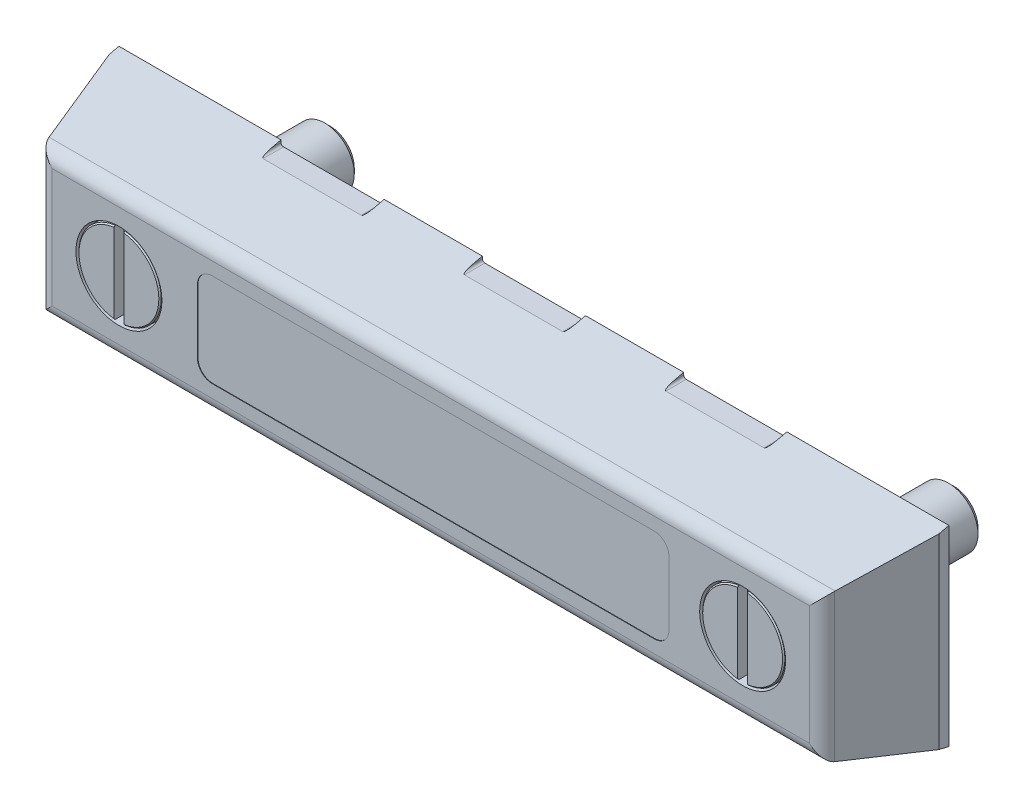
ISO-10303-21;
HEADER;
FILE_DESCRIPTION(('STEP AP214'),'2;1');
FILE_NAME('part.step','',(''),(''),'','','');
FILE_SCHEMA(('AUTOMOTIVE_DESIGN { 1 0 10303 214 1 1 1 1 }'));
ENDSEC;
DATA;
#1=APPLICATION_CONTEXT('core data for automotive mechanical design processes');
#2=APPLICATION_PROTOCOL_DEFINITION('international standard','automotive_design',2000,#1);
#3=PRODUCT_CONTEXT('',#1,'mechanical');
#4=PRODUCT('Part','Part','',(#3));
#5=PRODUCT_RELATED_PRODUCT_CATEGORY('part','',(#4));
#6=PRODUCT_DEFINITION_FORMATION('','',#4);
#7=PRODUCT_DEFINITION_CONTEXT('part definition',#1,'design');
#8=PRODUCT_DEFINITION('design','',#6,#7);
#9=PRODUCT_DEFINITION_SHAPE('','',#8);
#10=(LENGTH_UNIT() NAMED_UNIT(*) SI_UNIT(.MILLI.,.METRE.));
#11=(NAMED_UNIT(*) PLANE_ANGLE_UNIT() SI_UNIT($,.RADIAN.));
#12=(NAMED_UNIT(*) SI_UNIT($,.STERADIAN.) SOLID_ANGLE_UNIT());
#13=UNCERTAINTY_MEASURE_WITH_UNIT(LENGTH_MEASURE(1.E-05),#10,'distance_accuracy_value','');
#14=(GEOMETRIC_REPRESENTATION_CONTEXT(3) GLOBAL_UNCERTAINTY_ASSIGNED_CONTEXT((#13)) GLOBAL_UNIT_ASSIGNED_CONTEXT((#10,
#11,#12)) REPRESENTATION_CONTEXT('',''));
#15=CARTESIAN_POINT('',(0.,0.,0.));
#16=DIRECTION('',(0.,0.,1.));
#17=DIRECTION('',(1.,0.,0.));
#18=AXIS2_PLACEMENT_3D('',#15,#16,#17);
#19=CARTESIAN_POINT('',(109.,-6.5,20.9));
#20=DIRECTION('',(0.,0.,1.));
#21=DIRECTION('',(0.,1.,0.));
#22=AXIS2_PLACEMENT_3D('',#19,#20,#21);
#23=PLANE('',#22);
#24=DIRECTION('',(1.,0.,0.));
#25=VECTOR('',#24,1.);
#26=CARTESIAN_POINT('',(19.,-9.5,20.9));
#27=LINE('',#26,#25);
#28=CARTESIAN_POINT('',(19.,-9.5,20.9));
#29=VERTEX_POINT('',#28);
#30=CARTESIAN_POINT('',(109.,-9.5,20.9));
#31=VERTEX_POINT('',#30);
#32=EDGE_CURVE('E1278',#29,#31,#27,.T.);
#33=ORIENTED_EDGE('',*,*,#32,.T.);
#34=CARTESIAN_POINT('',(109.,-6.5,20.9));
#35=DIRECTION('',(0.,0.,1.));
#36=DIRECTION('',(0.,1.,0.));
#37=AXIS2_PLACEMENT_3D('',#34,#35,#36);
#38=CIRCLE('',#37,3.);
#39=CARTESIAN_POINT('',(112.,-6.5,20.9));
#40=VERTEX_POINT('',#39);
#41=EDGE_CURVE('E1747',#31,#40,#38,.T.);
#42=ORIENTED_EDGE('',*,*,#41,.T.);
#43=DIRECTION('',(0.,1.,0.));
#44=VECTOR('',#43,1.);
#45=CARTESIAN_POINT('',(112.,-6.5,20.9));
#46=LINE('',#45,#44);
#47=CARTESIAN_POINT('',(112.,6.5,20.9));
#48=VERTEX_POINT('',#47);
#49=EDGE_CURVE('E1750',#40,#48,#46,.T.);
#50=ORIENTED_EDGE('',*,*,#49,.T.);
#51=CARTESIAN_POINT('',(109.,6.5,20.9));
#52=DIRECTION('',(0.,0.,1.));
#53=DIRECTION('',(0.,1.,0.));
#54=AXIS2_PLACEMENT_3D('',#51,#52,#53);
#55=CIRCLE('',#54,3.);
#56=CARTESIAN_POINT('',(109.,9.5,20.9));
#57=VERTEX_POINT('',#56);
#58=EDGE_CURVE('E1758',#48,#57,#55,.T.);
#59=ORIENTED_EDGE('',*,*,#58,.T.);
#60=DIRECTION('',(-1.,0.,0.));
#61=VECTOR('',#60,1.);
#62=CARTESIAN_POINT('',(109.,9.5,20.9));
#63=LINE('',#62,#61);
#64=CARTESIAN_POINT('',(19.,9.5,20.9));
#65=VERTEX_POINT('',#64);
#66=EDGE_CURVE('E1761',#57,#65,#63,.T.);
#67=ORIENTED_EDGE('',*,*,#66,.T.);
#68=CARTESIAN_POINT('',(19.,6.5,20.9));
#69=DIRECTION('',(0.,0.,1.));
#70=DIRECTION('',(0.,1.,0.));
#71=AXIS2_PLACEMENT_3D('',#68,#69,#70);
#72=CIRCLE('',#71,3.);
#73=CARTESIAN_POINT('',(16.,6.5,20.9));
#74=VERTEX_POINT('',#73);
#75=EDGE_CURVE('E1764',#65,#74,#72,.T.);
#76=ORIENTED_EDGE('',*,*,#75,.T.);
#77=DIRECTION('',(0.,-1.,0.));
#78=VECTOR('',#77,1.);
#79=CARTESIAN_POINT('',(16.,6.5,20.9));
#80=LINE('',#79,#78);
#81=CARTESIAN_POINT('',(16.,-6.5,20.9));
#82=VERTEX_POINT('',#81);
#83=EDGE_CURVE('E1766',#74,#82,#80,.T.);
#84=ORIENTED_EDGE('',*,*,#83,.T.);
#85=CARTESIAN_POINT('',(19.,-6.5,20.9));
#86=DIRECTION('',(0.,0.,1.));
#87=DIRECTION('',(0.,1.,0.));
#88=AXIS2_PLACEMENT_3D('',#85,#86,#87);
#89=CIRCLE('',#88,3.);
#90=EDGE_CURVE('E1260',#82,#29,#89,.T.);
#91=ORIENTED_EDGE('',*,*,#90,.T.);
#92=EDGE_LOOP('',(#33,#42,#50,#59,#67,#76,#84,#91));
#93=FACE_BOUND('',#92,.T.);
#94=ADVANCED_FACE('F14',(#93),#23,.T.);
#95=CARTESIAN_POINT('',(-13.6069843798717,20.5,18.));
#96=DIRECTION('',(0.,-1.,0.));
#97=DIRECTION('',(0.,0.,1.));
#98=AXIS2_PLACEMENT_3D('',#95,#96,#97);
#99=CYLINDRICAL_SURFACE('',#98,3.00000000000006);
#100=DIRECTION('',(0.,-1.,0.));
#101=VECTOR('',#100,1.);
#102=CARTESIAN_POINT('',(-13.6069843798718,20.5,21.));
#103=LINE('',#102,#101);
#104=CARTESIAN_POINT('',(-13.6069843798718,12.1304238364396,21.));
#105=VERTEX_POINT('',#104);
#106=CARTESIAN_POINT('',(-13.6069843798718,-12.1304238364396,21.));
#107=VERTEX_POINT('',#106);
#108=EDGE_CURVE('E478',#105,#107,#103,.T.);
#109=ORIENTED_EDGE('',*,*,#108,.F.);
#110=CARTESIAN_POINT('',(-13.6069843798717,12.1304238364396,18.));
#111=DIRECTION('',(0.707106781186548,0.707106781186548,0.));
#112=DIRECTION('',(0.707106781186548,-0.707106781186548,0.));
#113=AXIS2_PLACEMENT_3D('',#110,#111,#112);
#114=ELLIPSE('',#113,4.24264068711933,3.);
#115=CARTESIAN_POINT('',(-16.504761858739,15.0282013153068,18.7764571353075));
#116=VERTEX_POINT('',#115);
#117=EDGE_CURVE('E562',#116,#105,#114,.T.);
#118=ORIENTED_EDGE('',*,*,#117,.F.);
#119=DIRECTION('',(0.,-1.,0.));
#120=VECTOR('',#119,1.);
#121=CARTESIAN_POINT('',(-16.504761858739,20.5,18.7764571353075));
#122=LINE('',#121,#120);
#123=CARTESIAN_POINT('',(-16.504761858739,-15.0282013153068,18.7764571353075));
#124=VERTEX_POINT('',#123);
#125=EDGE_CURVE('E475',#116,#124,#122,.T.);
#126=ORIENTED_EDGE('',*,*,#125,.T.);
#127=CARTESIAN_POINT('',(-13.6069843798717,-12.1304238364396,18.));
#128=DIRECTION('',(0.707106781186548,-0.707106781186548,0.));
#129=DIRECTION('',(0.707106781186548,0.707106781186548,0.));
#130=AXIS2_PLACEMENT_3D('',#127,#128,#129);
#131=ELLIPSE('',#130,4.24264068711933,3.);
#132=EDGE_CURVE('E511',#107,#124,#131,.T.);
#133=ORIENTED_EDGE('',*,*,#132,.F.);
#134=EDGE_LOOP('',(#109,#118,#126,#133));
#135=FACE_BOUND('',#134,.T.);
#136=ADVANCED_FACE('F223',(#135),#99,.T.);
#137=CARTESIAN_POINT('',(140.606984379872,20.5,18.));
#138=DIRECTION('',(0.,-1.,0.));
#139=DIRECTION('',(0.,0.,1.));
#140=AXIS2_PLACEMENT_3D('',#137,#138,#139);
#141=CYLINDRICAL_SURFACE('',#140,3.00000000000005);
#142=DIRECTION('',(0.,-1.,0.));
#143=VECTOR('',#142,1.);
#144=CARTESIAN_POINT('',(143.504761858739,20.5,18.7764571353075));
#145=LINE('',#144,#143);
#146=CARTESIAN_POINT('',(143.504761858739,15.0282013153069,18.7764571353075));
#147=VERTEX_POINT('',#146);
#148=CARTESIAN_POINT('',(143.504761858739,-15.0282013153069,18.7764571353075));
#149=VERTEX_POINT('',#148);
#150=EDGE_CURVE('E484',#147,#149,#145,.T.);
#151=ORIENTED_EDGE('',*,*,#150,.F.);
#152=CARTESIAN_POINT('',(140.606984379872,12.1304238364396,18.));
#153=DIRECTION('',(0.707106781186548,-0.707106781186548,0.));
#154=DIRECTION('',(0.707106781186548,0.707106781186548,0.));
#155=AXIS2_PLACEMENT_3D('',#152,#153,#154);
#156=ELLIPSE('',#155,4.24264068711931,3.);
#157=CARTESIAN_POINT('',(140.606984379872,12.1304238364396,21.));
#158=VERTEX_POINT('',#157);
#159=EDGE_CURVE('E565',#158,#147,#156,.F.);
#160=ORIENTED_EDGE('',*,*,#159,.F.);
#161=DIRECTION('',(0.,-1.,0.));
#162=VECTOR('',#161,1.);
#163=CARTESIAN_POINT('',(140.606984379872,20.5,21.));
#164=LINE('',#163,#162);
#165=CARTESIAN_POINT('',(140.606984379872,-12.1304238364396,21.));
#166=VERTEX_POINT('',#165);
#167=EDGE_CURVE('E481',#158,#166,#164,.T.);
#168=ORIENTED_EDGE('',*,*,#167,.T.);
#169=CARTESIAN_POINT('',(140.606984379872,-12.1304238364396,18.));
#170=DIRECTION('',(0.707106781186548,0.707106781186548,0.));
#171=DIRECTION('',(0.707106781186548,-0.707106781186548,0.));
#172=AXIS2_PLACEMENT_3D('',#169,#170,#171);
#173=ELLIPSE('',#172,4.24264068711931,3.);
#174=EDGE_CURVE('E514',#149,#166,#173,.F.);
#175=ORIENTED_EDGE('',*,*,#174,.F.);
#176=EDGE_LOOP('',(#151,#160,#168,#175));
#177=FACE_BOUND('',#176,.T.);
#178=ADVANCED_FACE('F230',(#177),#141,.T.);
#179=CARTESIAN_POINT('',(-21.,-12.1304238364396,18.));
#180=DIRECTION('',(1.,0.,0.));
#181=DIRECTION('',(0.,0.,-1.));
#182=AXIS2_PLACEMENT_3D('',#179,#180,#181);
#183=CYLINDRICAL_SURFACE('',#182,3.);
#184=CARTESIAN_POINT('',(143.712812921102,-12.1304238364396,18.));
#185=DIRECTION('',(0.965925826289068,0.,0.258819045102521));
#186=DIRECTION('',(0.258819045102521,0.,-0.965925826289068));
#187=AXIS2_PLACEMENT_3D('',#184,#185,#186);
#188=ELLIPSE('',#187,3.10582854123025,3.);
#189=CARTESIAN_POINT('',(143.526625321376,-15.0488424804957,18.6948615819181));
#190=VERTEX_POINT('',#189);
#191=EDGE_CURVE('E496',#149,#190,#188,.T.);
#192=ORIENTED_EDGE('',*,*,#191,.F.);
#193=ORIENTED_EDGE('',*,*,#174,.T.);
#194=DIRECTION('',(1.,0.,0.));
#195=VECTOR('',#194,1.);
#196=CARTESIAN_POINT('',(-21.,-12.1304238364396,21.));
#197=LINE('',#196,#195);
#198=EDGE_CURVE('E545',#107,#166,#197,.T.);
#199=ORIENTED_EDGE('',*,*,#198,.F.);
#200=ORIENTED_EDGE('',*,*,#132,.T.);
#201=CARTESIAN_POINT('',(-16.712812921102,-12.1304238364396,18.));
#202=DIRECTION('',(-0.965925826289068,0.,0.258819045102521));
#203=DIRECTION('',(0.258819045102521,0.,0.965925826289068));
#204=AXIS2_PLACEMENT_3D('',#201,#202,#203);
#205=ELLIPSE('',#204,3.10582854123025,3.);
#206=CARTESIAN_POINT('',(-16.5266253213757,-15.0488424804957,18.6948615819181));
#207=VERTEX_POINT('',#206);
#208=EDGE_CURVE('E508',#207,#124,#205,.T.);
#209=ORIENTED_EDGE('',*,*,#208,.F.);
#210=DIRECTION('',(1.,0.,0.));
#211=VECTOR('',#210,1.);
#212=CARTESIAN_POINT('',(-21.,-15.0488424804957,18.6948615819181));
#213=LINE('',#212,#211);
#214=EDGE_CURVE('E548',#207,#190,#213,.T.);
#215=ORIENTED_EDGE('',*,*,#214,.T.);
#216=EDGE_LOOP('',(#192,#193,#199,#200,#209,#215));
#217=FACE_BOUND('',#216,.T.);
#218=ADVANCED_FACE('F415',(#217),#183,.T.);
#219=CARTESIAN_POINT('',(151.215390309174,20.5,-10.));
#220=DIRECTION('',(0.965925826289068,0.,0.258819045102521));
#221=DIRECTION('',(0.258819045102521,0.,-0.965925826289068));
#222=AXIS2_PLACEMENT_3D('',#219,#220,#221);
#223=PLANE('',#222);
#224=ORIENTED_EDGE('',*,*,#191,.T.);
#225=DIRECTION('',(0.252234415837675,-0.224131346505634,-0.941351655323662));
#226=VECTOR('',#225,1.);
#227=CARTESIAN_POINT('',(137.749651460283,-9.91551867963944,40.2548215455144));
#228=LINE('',#227,#226);
#229=CARTESIAN_POINT('',(148.,-19.0238095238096,1.99999999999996));
#230=VERTEX_POINT('',#229);
#231=EDGE_CURVE('E493',#190,#230,#228,.T.);
#232=ORIENTED_EDGE('',*,*,#231,.T.);
#233=DIRECTION('',(0.,1.,0.));
#234=VECTOR('',#233,1.);
#235=CARTESIAN_POINT('',(148.,-12.1304238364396,1.99999999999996));
#236=LINE('',#235,#234);
#237=CARTESIAN_POINT('',(148.,19.0238095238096,1.99999999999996));
#238=VERTEX_POINT('',#237);
#239=EDGE_CURVE('E555',#230,#238,#236,.T.);
#240=ORIENTED_EDGE('',*,*,#239,.T.);
#241=DIRECTION('',(-0.252234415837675,-0.224131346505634,0.941351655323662));
#242=VECTOR('',#241,1.);
#243=CARTESIAN_POINT('',(133.059079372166,5.74755359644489,57.7602748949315));
#244=LINE('',#243,#242);
#245=CARTESIAN_POINT('',(143.526625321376,15.0488424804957,18.6948615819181));
#246=VERTEX_POINT('',#245);
#247=EDGE_CURVE('E487',#238,#246,#244,.T.);
#248=ORIENTED_EDGE('',*,*,#247,.T.);
#249=CARTESIAN_POINT('',(143.712812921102,12.1304238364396,18.));
#250=DIRECTION('',(0.965925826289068,0.,0.258819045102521));
#251=DIRECTION('',(0.258819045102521,0.,-0.965925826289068));
#252=AXIS2_PLACEMENT_3D('',#249,#250,#251);
#253=ELLIPSE('',#252,3.10582854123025,3.);
#254=EDGE_CURVE('E490',#246,#147,#253,.T.);
#255=ORIENTED_EDGE('',*,*,#254,.T.);
#256=ORIENTED_EDGE('',*,*,#150,.T.);
#257=EDGE_LOOP('',(#224,#232,#240,#248,#255,#256));
#258=FACE_BOUND('',#257,.T.);
#259=ADVANCED_FACE('F417',(#258),#223,.T.);
#260=CARTESIAN_POINT('',(-21.,12.1304238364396,18.));
#261=DIRECTION('',(1.,0.,0.));
#262=DIRECTION('',(0.,0.,-1.));
#263=AXIS2_PLACEMENT_3D('',#260,#261,#262);
#264=CYLINDRICAL_SURFACE('',#263,3.);
#265=ORIENTED_EDGE('',*,*,#254,.F.);
#266=DIRECTION('',(1.,0.,0.));
#267=VECTOR('',#266,1.);
#268=CARTESIAN_POINT('',(-21.,15.0488424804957,18.6948615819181));
#269=LINE('',#268,#267);
#270=CARTESIAN_POINT('',(-16.5266253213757,15.0488424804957,18.6948615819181));
#271=VERTEX_POINT('',#270);
#272=EDGE_CURVE('E539',#271,#246,#269,.T.);
#273=ORIENTED_EDGE('',*,*,#272,.F.);
#274=CARTESIAN_POINT('',(-16.712812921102,12.1304238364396,18.));
#275=DIRECTION('',(-0.965925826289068,0.,0.258819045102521));
#276=DIRECTION('',(0.258819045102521,0.,0.965925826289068));
#277=AXIS2_PLACEMENT_3D('',#274,#275,#276);
#278=ELLIPSE('',#277,3.10582854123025,3.);
#279=EDGE_CURVE('E502',#116,#271,#278,.T.);
#280=ORIENTED_EDGE('',*,*,#279,.F.);
#281=ORIENTED_EDGE('',*,*,#117,.T.);
#282=DIRECTION('',(1.,0.,0.));
#283=VECTOR('',#282,1.);
#284=CARTESIAN_POINT('',(-21.,12.1304238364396,21.));
#285=LINE('',#284,#283);
#286=EDGE_CURVE('E542',#105,#158,#285,.T.);
#287=ORIENTED_EDGE('',*,*,#286,.T.);
#288=ORIENTED_EDGE('',*,*,#159,.T.);
#289=EDGE_LOOP('',(#265,#273,#280,#281,#287,#288));
#290=FACE_BOUND('',#289,.T.);
#291=ADVANCED_FACE('F410',(#290),#264,.T.);
#292=CARTESIAN_POINT('',(-16.504761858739,20.5,18.7764571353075));
#293=DIRECTION('',(-0.965925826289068,0.,0.258819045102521));
#294=DIRECTION('',(0.258819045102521,0.,0.965925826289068));
#295=AXIS2_PLACEMENT_3D('',#292,#293,#294);
#296=PLANE('',#295);
#297=ORIENTED_EDGE('',*,*,#208,.T.);
#298=ORIENTED_EDGE('',*,*,#125,.F.);
#299=ORIENTED_EDGE('',*,*,#279,.T.);
#300=DIRECTION('',(-0.252234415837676,0.224131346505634,-0.941351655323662));
#301=VECTOR('',#300,1.);
#302=CARTESIAN_POINT('',(-16.8112312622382,15.3017386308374,17.6326977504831));
#303=LINE('',#302,#301);
#304=CARTESIAN_POINT('',(-21.,19.0238095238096,1.99999999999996));
#305=VERTEX_POINT('',#304);
#306=EDGE_CURVE('E499',#271,#305,#303,.T.);
#307=ORIENTED_EDGE('',*,*,#306,.T.);
#308=DIRECTION('',(0.,1.,0.));
#309=VECTOR('',#308,1.);
#310=CARTESIAN_POINT('',(-21.,-12.1304238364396,1.99999999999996));
#311=LINE('',#310,#309);
#312=CARTESIAN_POINT('',(-21.,-19.0238095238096,1.99999999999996));
#313=VERTEX_POINT('',#312);
#314=EDGE_CURVE('E559',#313,#305,#311,.T.);
#315=ORIENTED_EDGE('',*,*,#314,.F.);
#316=DIRECTION('',(0.252234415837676,0.224131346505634,0.941351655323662));
#317=VECTOR('',#316,1.);
#318=CARTESIAN_POINT('',(-21.5018033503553,-19.4697037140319,0.127244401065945));
#319=LINE('',#318,#317);
#320=EDGE_CURVE('E505',#313,#207,#319,.T.);
#321=ORIENTED_EDGE('',*,*,#320,.T.);
#322=EDGE_LOOP('',(#297,#298,#299,#307,#315,#321));
#323=FACE_BOUND('',#322,.T.);
#324=ADVANCED_FACE('F408',(#323),#296,.T.);
#325=CARTESIAN_POINT('',(-21.,-12.1304238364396,18.));
#326=DIRECTION('',(-1.,0.,0.));
#327=DIRECTION('',(0.,0.,1.));
#328=AXIS2_PLACEMENT_3D('',#325,#326,#327);
#329=PLANE('',#328);
#330=DIRECTION('',(0.,0.231620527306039,0.972806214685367));
#331=VECTOR('',#330,1.);
#332=CARTESIAN_POINT('',(-21.,-19.5,0.));
#333=LINE('',#332,#331);
#334=CARTESIAN_POINT('',(-21.,-19.5,0.));
#335=VERTEX_POINT('',#334);
#336=EDGE_CURVE('E521',#335,#313,#333,.T.);
#337=ORIENTED_EDGE('',*,*,#336,.T.);
#338=ORIENTED_EDGE('',*,*,#314,.T.);
#339=DIRECTION('',(0.,0.23162052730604,-0.972806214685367));
#340=VECTOR('',#339,1.);
#341=CARTESIAN_POINT('',(-21.,15.0488424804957,18.6948615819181));
#342=LINE('',#341,#340);
#343=CARTESIAN_POINT('',(-21.,19.5,0.));
#344=VERTEX_POINT('',#343);
#345=EDGE_CURVE('E525',#305,#344,#342,.T.);
#346=ORIENTED_EDGE('',*,*,#345,.T.);
#347=DIRECTION('',(0.,-1.,0.));
#348=VECTOR('',#347,1.);
#349=CARTESIAN_POINT('',(-21.,19.5,0.));
#350=LINE('',#349,#348);
#351=EDGE_CURVE('E518',#344,#335,#350,.T.);
#352=ORIENTED_EDGE('',*,*,#351,.T.);
#353=EDGE_LOOP('',(#337,#338,#346,#352));
#354=FACE_BOUND('',#353,.T.);
#355=ADVANCED_FACE('F334',(#354),#329,.T.);
#356=CARTESIAN_POINT('',(12.,-19.011,21.));
#357=DIRECTION('',(1.,0.,0.));
#358=DIRECTION('',(0.,0.,-1.));
#359=AXIS2_PLACEMENT_3D('',#356,#357,#358);
#360=PLANE('',#359);
#361=DIRECTION('',(0.,-0.231620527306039,-0.972806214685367));
#362=VECTOR('',#361,1.);
#363=CARTESIAN_POINT('',(12.,-19.5,0.));
#364=LINE('',#363,#362);
#365=CARTESIAN_POINT('',(12.,-19.011,2.05379999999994));
#366=VERTEX_POINT('',#365);
#367=CARTESIAN_POINT('',(12.,-19.5,0.));
#368=VERTEX_POINT('',#367);
#369=EDGE_CURVE('E1416',#366,#368,#364,.T.);
#370=ORIENTED_EDGE('',*,*,#369,.T.);
#371=DIRECTION('',(0.,1.,0.));
#372=VECTOR('',#371,1.);
#373=CARTESIAN_POINT('',(12.,19.5,0.));
#374=LINE('',#373,#372);
#375=CARTESIAN_POINT('',(12.,-19.011,0.));
#376=VERTEX_POINT('',#375);
#377=EDGE_CURVE('E568',#368,#376,#374,.T.);
#378=ORIENTED_EDGE('',*,*,#377,.T.);
#379=DIRECTION('',(0.,0.,-1.));
#380=VECTOR('',#379,1.);
#381=CARTESIAN_POINT('',(12.,-19.011,21.));
#382=LINE('',#381,#380);
#383=EDGE_CURVE('E1380',#366,#376,#382,.T.);
#384=ORIENTED_EDGE('',*,*,#383,.F.);
#385=EDGE_LOOP('',(#370,#378,#384));
#386=FACE_BOUND('',#385,.T.);
#387=ADVANCED_FACE('F330',(#386),#360,.T.);
#388=CARTESIAN_POINT('',(12.5,-19.011,21.));
#389=DIRECTION('',(0.,0.,-1.));
#390=DIRECTION('',(0.,-1.,0.));
#391=AXIS2_PLACEMENT_3D('',#388,#389,#390);
#392=CYLINDRICAL_SURFACE('',#391,0.500000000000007);
#393=CARTESIAN_POINT('',(12.5,-19.011,2.05379999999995));
#394=DIRECTION('',(0.,0.972806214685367,-0.231620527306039));
#395=DIRECTION('',(0.,-0.23162052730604,-0.972806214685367));
#396=AXIS2_PLACEMENT_3D('',#393,#394,#395);
#397=ELLIPSE('',#396,2.15870331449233,0.500000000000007);
#398=CARTESIAN_POINT('',(12.5,-18.511,4.1538));
#399=VERTEX_POINT('',#398);
#400=EDGE_CURVE('E1419',#399,#366,#397,.F.);
#401=ORIENTED_EDGE('',*,*,#400,.T.);
#402=ORIENTED_EDGE('',*,*,#383,.T.);
#403=CARTESIAN_POINT('',(12.5,-19.011,0.));
#404=DIRECTION('',(0.,0.,1.));
#405=DIRECTION('',(0.,1.,0.));
#406=AXIS2_PLACEMENT_3D('',#403,#404,#405);
#407=CIRCLE('',#406,0.500000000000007);
#408=CARTESIAN_POINT('',(12.5,-18.511,0.));
#409=VERTEX_POINT('',#408);
#410=EDGE_CURVE('E571',#376,#409,#407,.F.);
#411=ORIENTED_EDGE('',*,*,#410,.T.);
#412=DIRECTION('',(0.,0.,-1.));
#413=VECTOR('',#412,1.);
#414=CARTESIAN_POINT('',(12.5,-18.511,21.));
#415=LINE('',#414,#413);
#416=EDGE_CURVE('E1383',#399,#409,#415,.T.);
#417=ORIENTED_EDGE('',*,*,#416,.F.);
#418=EDGE_LOOP('',(#401,#402,#411,#417));
#419=FACE_BOUND('',#418,.T.);
#420=ADVANCED_FACE('F333',(#419),#392,.F.);
#421=CARTESIAN_POINT('',(32.5,-18.511,21.));
#422=DIRECTION('',(0.,-1.,0.));
#423=DIRECTION('',(0.,0.,1.));
#424=AXIS2_PLACEMENT_3D('',#421,#422,#423);
#425=PLANE('',#424);
#426=DIRECTION('',(-1.,0.,0.));
#427=VECTOR('',#426,1.);
#428=CARTESIAN_POINT('',(-21.,-18.511,4.1538));
#429=LINE('',#428,#427);
#430=CARTESIAN_POINT('',(32.5,-18.511,4.1538));
#431=VERTEX_POINT('',#430);
#432=EDGE_CURVE('E1422',#431,#399,#429,.T.);
#433=ORIENTED_EDGE('',*,*,#432,.T.);
#434=ORIENTED_EDGE('',*,*,#416,.T.);
#435=DIRECTION('',(1.,0.,0.));
#436=VECTOR('',#435,1.);
#437=CARTESIAN_POINT('',(-21.,-18.511,0.));
#438=LINE('',#437,#436);
#439=CARTESIAN_POINT('',(32.5,-18.511,0.));
#440=VERTEX_POINT('',#439);
#441=EDGE_CURVE('E574',#409,#440,#438,.T.);
#442=ORIENTED_EDGE('',*,*,#441,.T.);
#443=DIRECTION('',(0.,0.,-1.));
#444=VECTOR('',#443,1.);
#445=CARTESIAN_POINT('',(32.5,-18.511,21.));
#446=LINE('',#445,#444);
#447=EDGE_CURVE('E1386',#431,#440,#446,.T.);
#448=ORIENTED_EDGE('',*,*,#447,.F.);
#449=EDGE_LOOP('',(#433,#434,#442,#448));
#450=FACE_BOUND('',#449,.T.);
#451=ADVANCED_FACE('F338',(#450),#425,.T.);
#452=CARTESIAN_POINT('',(32.5,-19.011,21.));
#453=DIRECTION('',(0.,0.,-1.));
#454=DIRECTION('',(0.,-1.,0.));
#455=AXIS2_PLACEMENT_3D('',#452,#453,#454);
#456=CYLINDRICAL_SURFACE('',#455,0.5);
#457=CARTESIAN_POINT('',(32.5,-19.011,2.05379999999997));
#458=DIRECTION('',(0.,0.972806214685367,-0.231620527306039));
#459=DIRECTION('',(0.,-0.23162052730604,-0.972806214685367));
#460=AXIS2_PLACEMENT_3D('',#457,#458,#459);
#461=ELLIPSE('',#460,2.1587033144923,0.5);
#462=CARTESIAN_POINT('',(33.,-19.011,2.0538));
#463=VERTEX_POINT('',#462);
#464=EDGE_CURVE('E1425',#463,#431,#461,.F.);
#465=ORIENTED_EDGE('',*,*,#464,.T.);
#466=ORIENTED_EDGE('',*,*,#447,.T.);
#467=CARTESIAN_POINT('',(32.5,-19.011,0.));
#468=DIRECTION('',(0.,0.,1.));
#469=DIRECTION('',(0.,1.,0.));
#470=AXIS2_PLACEMENT_3D('',#467,#468,#469);
#471=CIRCLE('',#470,0.5);
#472=CARTESIAN_POINT('',(33.,-19.011,0.));
#473=VERTEX_POINT('',#472);
#474=EDGE_CURVE('E577',#440,#473,#471,.F.);
#475=ORIENTED_EDGE('',*,*,#474,.T.);
#476=DIRECTION('',(0.,0.,-1.));
#477=VECTOR('',#476,1.);
#478=CARTESIAN_POINT('',(33.,-19.011,21.));
#479=LINE('',#478,#477);
#480=EDGE_CURVE('E1389',#463,#473,#479,.T.);
#481=ORIENTED_EDGE('',*,*,#480,.F.);
#482=EDGE_LOOP('',(#465,#466,#475,#481));
#483=FACE_BOUND('',#482,.T.);
#484=ADVANCED_FACE('F342',(#483),#456,.F.);
#485=CARTESIAN_POINT('',(33.,-19.501,21.));
#486=DIRECTION('',(-1.,0.,0.));
#487=DIRECTION('',(0.,-1.,0.));
#488=AXIS2_PLACEMENT_3D('',#485,#486,#487);
#489=PLANE('',#488);
#490=DIRECTION('',(0.,0.231620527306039,0.972806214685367));
#491=VECTOR('',#490,1.);
#492=CARTESIAN_POINT('',(33.,-19.5,1.72302393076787E-13));
#493=LINE('',#492,#491);
#494=CARTESIAN_POINT('',(33.,-19.5,0.));
#495=VERTEX_POINT('',#494);
#496=EDGE_CURVE('E1428',#495,#463,#493,.T.);
#497=ORIENTED_EDGE('',*,*,#496,.T.);
#498=ORIENTED_EDGE('',*,*,#480,.T.);
#499=DIRECTION('',(0.,-1.,0.));
#500=VECTOR('',#499,1.);
#501=CARTESIAN_POINT('',(32.9999999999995,19.5000000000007,0.));
#502=LINE('',#501,#500);
#503=EDGE_CURVE('E580',#473,#495,#502,.T.);
#504=ORIENTED_EDGE('',*,*,#503,.T.);
#505=EDGE_LOOP('',(#497,#498,#504));
#506=FACE_BOUND('',#505,.T.);
#507=ADVANCED_FACE('F346',(#506),#489,.T.);
#508=CARTESIAN_POINT('',(53.,-19.011,21.));
#509=DIRECTION('',(1.,0.,0.));
#510=DIRECTION('',(0.,0.,-1.));
#511=AXIS2_PLACEMENT_3D('',#508,#509,#510);
#512=PLANE('',#511);
#513=DIRECTION('',(0.,-0.231620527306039,-0.972806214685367));
#514=VECTOR('',#513,1.);
#515=CARTESIAN_POINT('',(53.,-19.5,0.));
#516=LINE('',#515,#514);
#517=CARTESIAN_POINT('',(53.,-19.011,2.05379999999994));
#518=VERTEX_POINT('',#517);
#519=CARTESIAN_POINT('',(53.,-19.5,0.));
#520=VERTEX_POINT('',#519);
#521=EDGE_CURVE('E1431',#518,#520,#516,.T.);
#522=ORIENTED_EDGE('',*,*,#521,.T.);
#523=DIRECTION('',(0.,1.,0.));
#524=VECTOR('',#523,1.);
#525=CARTESIAN_POINT('',(53.,19.5,0.));
#526=LINE('',#525,#524);
#527=CARTESIAN_POINT('',(53.,-19.011,0.));
#528=VERTEX_POINT('',#527);
#529=EDGE_CURVE('E583',#520,#528,#526,.T.);
#530=ORIENTED_EDGE('',*,*,#529,.T.);
#531=DIRECTION('',(0.,0.,-1.));
#532=VECTOR('',#531,1.);
#533=CARTESIAN_POINT('',(53.,-19.011,21.));
#534=LINE('',#533,#532);
#535=EDGE_CURVE('E1392',#518,#528,#534,.T.);
#536=ORIENTED_EDGE('',*,*,#535,.F.);
#537=EDGE_LOOP('',(#522,#530,#536));
#538=FACE_BOUND('',#537,.T.);
#539=ADVANCED_FACE('F350',(#538),#512,.T.);
#540=CARTESIAN_POINT('',(53.5,-19.011,21.));
#541=DIRECTION('',(0.,0.,-1.));
#542=DIRECTION('',(0.,-1.,0.));
#543=AXIS2_PLACEMENT_3D('',#540,#541,#542);
#544=CYLINDRICAL_SURFACE('',#543,0.500000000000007);
#545=CARTESIAN_POINT('',(53.5,-19.011,2.05379999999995));
#546=DIRECTION('',(0.,0.972806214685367,-0.231620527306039));
#547=DIRECTION('',(0.,-0.23162052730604,-0.972806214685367));
#548=AXIS2_PLACEMENT_3D('',#545,#546,#547);
#549=ELLIPSE('',#548,2.15870331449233,0.500000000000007);
#550=CARTESIAN_POINT('',(53.5,-18.511,4.1538));
#551=VERTEX_POINT('',#550);
#552=EDGE_CURVE('E1434',#551,#518,#549,.F.);
#553=ORIENTED_EDGE('',*,*,#552,.T.);
#554=ORIENTED_EDGE('',*,*,#535,.T.);
#555=CARTESIAN_POINT('',(53.5,-19.011,0.));
#556=DIRECTION('',(0.,0.,1.));
#557=DIRECTION('',(0.,1.,0.));
#558=AXIS2_PLACEMENT_3D('',#555,#556,#557);
#559=CIRCLE('',#558,0.500000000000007);
#560=CARTESIAN_POINT('',(53.5,-18.511,0.));
#561=VERTEX_POINT('',#560);
#562=EDGE_CURVE('E586',#528,#561,#559,.F.);
#563=ORIENTED_EDGE('',*,*,#562,.T.);
#564=DIRECTION('',(0.,0.,-1.));
#565=VECTOR('',#564,1.);
#566=CARTESIAN_POINT('',(53.5,-18.511,21.));
#567=LINE('',#566,#565);
#568=EDGE_CURVE('E1395',#551,#561,#567,.T.);
#569=ORIENTED_EDGE('',*,*,#568,.F.);
#570=EDGE_LOOP('',(#553,#554,#563,#569));
#571=FACE_BOUND('',#570,.T.);
#572=ADVANCED_FACE('F354',(#571),#544,.F.);
#573=CARTESIAN_POINT('',(73.5,-18.511,21.));
#574=DIRECTION('',(0.,-1.,0.));
#575=DIRECTION('',(0.,0.,1.));
#576=AXIS2_PLACEMENT_3D('',#573,#574,#575);
#577=PLANE('',#576);
#578=DIRECTION('',(-1.,0.,0.));
#579=VECTOR('',#578,1.);
#580=CARTESIAN_POINT('',(-21.,-18.511,4.1538));
#581=LINE('',#580,#579);
#582=CARTESIAN_POINT('',(73.5,-18.511,4.1538));
#583=VERTEX_POINT('',#582);
#584=EDGE_CURVE('E1437',#583,#551,#581,.T.);
#585=ORIENTED_EDGE('',*,*,#584,.T.);
#586=ORIENTED_EDGE('',*,*,#568,.T.);
#587=DIRECTION('',(1.,0.,0.));
#588=VECTOR('',#587,1.);
#589=CARTESIAN_POINT('',(-21.,-18.511,0.));
#590=LINE('',#589,#588);
#591=CARTESIAN_POINT('',(73.5,-18.511,0.));
#592=VERTEX_POINT('',#591);
#593=EDGE_CURVE('E589',#561,#592,#590,.T.);
#594=ORIENTED_EDGE('',*,*,#593,.T.);
#595=DIRECTION('',(0.,0.,-1.));
#596=VECTOR('',#595,1.);
#597=CARTESIAN_POINT('',(73.5,-18.511,21.));
#598=LINE('',#597,#596);
#599=EDGE_CURVE('E1398',#583,#592,#598,.T.);
#600=ORIENTED_EDGE('',*,*,#599,.F.);
#601=EDGE_LOOP('',(#585,#586,#594,#600));
#602=FACE_BOUND('',#601,.T.);
#603=ADVANCED_FACE('F358',(#602),#577,.T.);
#604=CARTESIAN_POINT('',(73.5,-19.011,21.));
#605=DIRECTION('',(0.,0.,-1.));
#606=DIRECTION('',(0.,-1.,0.));
#607=AXIS2_PLACEMENT_3D('',#604,#605,#606);
#608=CYLINDRICAL_SURFACE('',#607,0.5);
#609=CARTESIAN_POINT('',(73.5,-19.011,2.05379999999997));
#610=DIRECTION('',(0.,0.972806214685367,-0.231620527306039));
#611=DIRECTION('',(0.,-0.23162052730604,-0.972806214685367));
#612=AXIS2_PLACEMENT_3D('',#609,#610,#611);
#613=ELLIPSE('',#612,2.15870331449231,0.5);
#614=CARTESIAN_POINT('',(74.,-19.011,2.0538));
#615=VERTEX_POINT('',#614);
#616=EDGE_CURVE('E1440',#615,#583,#613,.F.);
#617=ORIENTED_EDGE('',*,*,#616,.T.);
#618=ORIENTED_EDGE('',*,*,#599,.T.);
#619=CARTESIAN_POINT('',(73.5,-19.011,0.));
#620=DIRECTION('',(0.,0.,1.));
#621=DIRECTION('',(0.,1.,0.));
#622=AXIS2_PLACEMENT_3D('',#619,#620,#621);
#623=CIRCLE('',#622,0.5);
#624=CARTESIAN_POINT('',(74.,-19.011,0.));
#625=VERTEX_POINT('',#624);
#626=EDGE_CURVE('E592',#592,#625,#623,.F.);
#627=ORIENTED_EDGE('',*,*,#626,.T.);
#628=DIRECTION('',(0.,0.,-1.));
#629=VECTOR('',#628,1.);
#630=CARTESIAN_POINT('',(74.,-19.011,21.));
#631=LINE('',#630,#629);
#632=EDGE_CURVE('E1401',#615,#625,#631,.T.);
#633=ORIENTED_EDGE('',*,*,#632,.F.);
#634=EDGE_LOOP('',(#617,#618,#627,#633));
#635=FACE_BOUND('',#634,.T.);
#636=ADVANCED_FACE('F362',(#635),#608,.F.);
#637=CARTESIAN_POINT('',(74.,-19.501,21.));
#638=DIRECTION('',(-1.,0.,0.));
#639=DIRECTION('',(0.,-1.,0.));
#640=AXIS2_PLACEMENT_3D('',#637,#638,#639);
#641=PLANE('',#640);
#642=DIRECTION('',(0.,0.231620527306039,0.972806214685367));
#643=VECTOR('',#642,1.);
#644=CARTESIAN_POINT('',(74.,-19.5,3.03124580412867E-13));
#645=LINE('',#644,#643);
#646=CARTESIAN_POINT('',(74.,-19.5,0.));
#647=VERTEX_POINT('',#646);
#648=EDGE_CURVE('E1443',#647,#615,#645,.T.);
#649=ORIENTED_EDGE('',*,*,#648,.T.);
#650=ORIENTED_EDGE('',*,*,#632,.T.);
#651=DIRECTION('',(0.,-1.,0.));
#652=VECTOR('',#651,1.);
#653=CARTESIAN_POINT('',(74.,19.5000000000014,0.));
#654=LINE('',#653,#652);
#655=EDGE_CURVE('E595',#625,#647,#654,.T.);
#656=ORIENTED_EDGE('',*,*,#655,.T.);
#657=EDGE_LOOP('',(#649,#650,#656));
#658=FACE_BOUND('',#657,.T.);
#659=ADVANCED_FACE('F366',(#658),#641,.T.);
#660=CARTESIAN_POINT('',(94.,-19.011,21.));
#661=DIRECTION('',(1.,0.,0.));
#662=DIRECTION('',(0.,0.,-1.));
#663=AXIS2_PLACEMENT_3D('',#660,#661,#662);
#664=PLANE('',#663);
#665=DIRECTION('',(0.,-0.231620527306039,-0.972806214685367));
#666=VECTOR('',#665,1.);
#667=CARTESIAN_POINT('',(94.,-19.5,0.));
#668=LINE('',#667,#666);
#669=CARTESIAN_POINT('',(94.,-19.011,2.05379999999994));
#670=VERTEX_POINT('',#669);
#671=CARTESIAN_POINT('',(94.,-19.5,0.));
#672=VERTEX_POINT('',#671);
#673=EDGE_CURVE('E1446',#670,#672,#668,.T.);
#674=ORIENTED_EDGE('',*,*,#673,.T.);
#675=DIRECTION('',(0.,1.,0.));
#676=VECTOR('',#675,1.);
#677=CARTESIAN_POINT('',(94.,19.5,0.));
#678=LINE('',#677,#676);
#679=CARTESIAN_POINT('',(94.,-19.011,0.));
#680=VERTEX_POINT('',#679);
#681=EDGE_CURVE('E598',#672,#680,#678,.T.);
#682=ORIENTED_EDGE('',*,*,#681,.T.);
#683=DIRECTION('',(0.,0.,-1.));
#684=VECTOR('',#683,1.);
#685=CARTESIAN_POINT('',(94.,-19.011,21.));
#686=LINE('',#685,#684);
#687=EDGE_CURVE('E1404',#670,#680,#686,.T.);
#688=ORIENTED_EDGE('',*,*,#687,.F.);
#689=EDGE_LOOP('',(#674,#682,#688));
#690=FACE_BOUND('',#689,.T.);
#691=ADVANCED_FACE('F370',(#690),#664,.T.);
#692=CARTESIAN_POINT('',(94.5,-19.011,21.));
#693=DIRECTION('',(0.,0.,-1.));
#694=DIRECTION('',(0.,-1.,0.));
#695=AXIS2_PLACEMENT_3D('',#692,#693,#694);
#696=CYLINDRICAL_SURFACE('',#695,0.500000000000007);
#697=CARTESIAN_POINT('',(94.5,-19.011,2.05379999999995));
#698=DIRECTION('',(0.,0.972806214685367,-0.231620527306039));
#699=DIRECTION('',(0.,-0.23162052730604,-0.972806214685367));
#700=AXIS2_PLACEMENT_3D('',#697,#698,#699);
#701=ELLIPSE('',#700,2.15870331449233,0.500000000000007);
#702=CARTESIAN_POINT('',(94.5,-18.511,4.1538));
#703=VERTEX_POINT('',#702);
#704=EDGE_CURVE('E1449',#703,#670,#701,.F.);
#705=ORIENTED_EDGE('',*,*,#704,.T.);
#706=ORIENTED_EDGE('',*,*,#687,.T.);
#707=CARTESIAN_POINT('',(94.5,-19.011,0.));
#708=DIRECTION('',(0.,0.,1.));
#709=DIRECTION('',(0.,1.,0.));
#710=AXIS2_PLACEMENT_3D('',#707,#708,#709);
#711=CIRCLE('',#710,0.500000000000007);
#712=CARTESIAN_POINT('',(94.5,-18.511,0.));
#713=VERTEX_POINT('',#712);
#714=EDGE_CURVE('E601',#680,#713,#711,.F.);
#715=ORIENTED_EDGE('',*,*,#714,.T.);
#716=DIRECTION('',(0.,0.,-1.));
#717=VECTOR('',#716,1.);
#718=CARTESIAN_POINT('',(94.5,-18.511,21.));
#719=LINE('',#718,#717);
#720=EDGE_CURVE('E1407',#703,#713,#719,.T.);
#721=ORIENTED_EDGE('',*,*,#720,.F.);
#722=EDGE_LOOP('',(#705,#706,#715,#721));
#723=FACE_BOUND('',#722,.T.);
#724=ADVANCED_FACE('F374',(#723),#696,.F.);
#725=CARTESIAN_POINT('',(114.5,-18.511,21.));
#726=DIRECTION('',(0.,-1.,0.));
#727=DIRECTION('',(0.,0.,1.));
#728=AXIS2_PLACEMENT_3D('',#725,#726,#727);
#729=PLANE('',#728);
#730=DIRECTION('',(-1.,0.,0.));
#731=VECTOR('',#730,1.);
#732=CARTESIAN_POINT('',(-21.,-18.511,4.1538));
#733=LINE('',#732,#731);
#734=CARTESIAN_POINT('',(114.5,-18.511,4.1538));
#735=VERTEX_POINT('',#734);
#736=EDGE_CURVE('E1452',#735,#703,#733,.T.);
#737=ORIENTED_EDGE('',*,*,#736,.T.);
#738=ORIENTED_EDGE('',*,*,#720,.T.);
#739=DIRECTION('',(1.,0.,0.));
#740=VECTOR('',#739,1.);
#741=CARTESIAN_POINT('',(-21.,-18.511,0.));
#742=LINE('',#741,#740);
#743=CARTESIAN_POINT('',(114.5,-18.511,0.));
#744=VERTEX_POINT('',#743);
#745=EDGE_CURVE('E604',#713,#744,#742,.T.);
#746=ORIENTED_EDGE('',*,*,#745,.T.);
#747=DIRECTION('',(0.,0.,-1.));
#748=VECTOR('',#747,1.);
#749=CARTESIAN_POINT('',(114.5,-18.511,21.));
#750=LINE('',#749,#748);
#751=EDGE_CURVE('E1410',#735,#744,#750,.T.);
#752=ORIENTED_EDGE('',*,*,#751,.F.);
#753=EDGE_LOOP('',(#737,#738,#746,#752));
#754=FACE_BOUND('',#753,.T.);
#755=ADVANCED_FACE('F378',(#754),#729,.T.);
#756=CARTESIAN_POINT('',(114.5,-19.011,21.));
#757=DIRECTION('',(0.,0.,-1.));
#758=DIRECTION('',(0.,-1.,0.));
#759=AXIS2_PLACEMENT_3D('',#756,#757,#758);
#760=CYLINDRICAL_SURFACE('',#759,0.500000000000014);
#761=CARTESIAN_POINT('',(114.5,-19.011,2.05379999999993));
#762=DIRECTION('',(0.,0.972806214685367,-0.231620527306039));
#763=DIRECTION('',(0.,-0.23162052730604,-0.972806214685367));
#764=AXIS2_PLACEMENT_3D('',#761,#762,#763);
#765=ELLIPSE('',#764,2.15870331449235,0.500000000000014);
#766=CARTESIAN_POINT('',(115.,-19.011,2.0538));
#767=VERTEX_POINT('',#766);
#768=EDGE_CURVE('E1455',#767,#735,#765,.F.);
#769=ORIENTED_EDGE('',*,*,#768,.T.);
#770=ORIENTED_EDGE('',*,*,#751,.T.);
#771=CARTESIAN_POINT('',(114.5,-19.011,0.));
#772=DIRECTION('',(0.,0.,1.));
#773=DIRECTION('',(0.,1.,0.));
#774=AXIS2_PLACEMENT_3D('',#771,#772,#773);
#775=CIRCLE('',#774,0.500000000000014);
#776=CARTESIAN_POINT('',(115.,-19.011,0.));
#777=VERTEX_POINT('',#776);
#778=EDGE_CURVE('E607',#744,#777,#775,.F.);
#779=ORIENTED_EDGE('',*,*,#778,.T.);
#780=DIRECTION('',(0.,0.,-1.));
#781=VECTOR('',#780,1.);
#782=CARTESIAN_POINT('',(115.,-19.011,21.));
#783=LINE('',#782,#781);
#784=EDGE_CURVE('E1413',#767,#777,#783,.T.);
#785=ORIENTED_EDGE('',*,*,#784,.F.);
#786=EDGE_LOOP('',(#769,#770,#779,#785));
#787=FACE_BOUND('',#786,.T.);
#788=ADVANCED_FACE('F382',(#787),#760,.F.);
#789=CARTESIAN_POINT('',(115.,-19.501,21.));
#790=DIRECTION('',(-1.,0.,0.));
#791=DIRECTION('',(0.,-1.,0.));
#792=AXIS2_PLACEMENT_3D('',#789,#790,#791);
#793=PLANE('',#792);
#794=DIRECTION('',(0.,0.231620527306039,0.972806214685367));
#795=VECTOR('',#794,1.);
#796=CARTESIAN_POINT('',(115.,-19.5,4.33946767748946E-13));
#797=LINE('',#796,#795);
#798=CARTESIAN_POINT('',(115.,-19.5,0.));
#799=VERTEX_POINT('',#798);
#800=EDGE_CURVE('E1458',#799,#767,#797,.T.);
#801=ORIENTED_EDGE('',*,*,#800,.T.);
#802=ORIENTED_EDGE('',*,*,#784,.T.);
#803=DIRECTION('',(0.,-1.,0.));
#804=VECTOR('',#803,1.);
#805=CARTESIAN_POINT('',(115.,19.500000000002,0.));
#806=LINE('',#805,#804);
#807=EDGE_CURVE('E610',#777,#799,#806,.T.);
#808=ORIENTED_EDGE('',*,*,#807,.T.);
#809=EDGE_LOOP('',(#801,#802,#808));
#810=FACE_BOUND('',#809,.T.);
#811=ADVANCED_FACE('F386',(#810),#793,.T.);
#812=CARTESIAN_POINT('',(-21.,-19.5,0.));
#813=DIRECTION('',(0.,0.972806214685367,-0.231620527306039));
#814=DIRECTION('',(0.,-0.23162052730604,-0.972806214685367));
#815=AXIS2_PLACEMENT_3D('',#812,#813,#814);
#816=PLANE('',#815);
#817=ORIENTED_EDGE('',*,*,#800,.F.);
#818=DIRECTION('',(1.,0.,0.));
#819=VECTOR('',#818,1.);
#820=CARTESIAN_POINT('',(-21.,-19.5,0.));
#821=LINE('',#820,#819);
#822=CARTESIAN_POINT('',(148.,-19.5,0.));
#823=VERTEX_POINT('',#822);
#824=EDGE_CURVE('E551',#799,#823,#821,.T.);
#825=ORIENTED_EDGE('',*,*,#824,.T.);
#826=DIRECTION('',(0.,0.231620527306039,0.972806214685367));
#827=VECTOR('',#826,1.);
#828=CARTESIAN_POINT('',(148.,-19.5,0.));
#829=LINE('',#828,#827);
#830=EDGE_CURVE('E531',#823,#230,#829,.T.);
#831=ORIENTED_EDGE('',*,*,#830,.T.);
#832=ORIENTED_EDGE('',*,*,#231,.F.);
#833=ORIENTED_EDGE('',*,*,#214,.F.);
#834=ORIENTED_EDGE('',*,*,#320,.F.);
#835=ORIENTED_EDGE('',*,*,#336,.F.);
#836=EDGE_CURVE('E552',#335,#368,#821,.T.);
#837=ORIENTED_EDGE('',*,*,#836,.T.);
#838=ORIENTED_EDGE('',*,*,#369,.F.);
#839=ORIENTED_EDGE('',*,*,#400,.F.);
#840=ORIENTED_EDGE('',*,*,#432,.F.);
#841=ORIENTED_EDGE('',*,*,#464,.F.);
#842=ORIENTED_EDGE('',*,*,#496,.F.);
#843=EDGE_CURVE('E556',#495,#520,#821,.T.);
#844=ORIENTED_EDGE('',*,*,#843,.T.);
#845=ORIENTED_EDGE('',*,*,#521,.F.);
#846=ORIENTED_EDGE('',*,*,#552,.F.);
#847=ORIENTED_EDGE('',*,*,#584,.F.);
#848=ORIENTED_EDGE('',*,*,#616,.F.);
#849=ORIENTED_EDGE('',*,*,#648,.F.);
#850=EDGE_CURVE('E1549',#647,#672,#821,.T.);
#851=ORIENTED_EDGE('',*,*,#850,.T.);
#852=ORIENTED_EDGE('',*,*,#673,.F.);
#853=ORIENTED_EDGE('',*,*,#704,.F.);
#854=ORIENTED_EDGE('',*,*,#736,.F.);
#855=ORIENTED_EDGE('',*,*,#768,.F.);
#856=EDGE_LOOP('',(#817,#825,#831,#832,#833,#834,#835,#837,#838,#839,#840,#841,#842,#844,#845,
#846,#847,#848,#849,#851,#852,#853,#854,#855));
#857=FACE_BOUND('',#856,.T.);
#858=ADVANCED_FACE('F390',(#857),#816,.F.);
#859=CARTESIAN_POINT('',(148.,-12.1304238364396,18.));
#860=DIRECTION('',(-1.,0.,0.));
#861=DIRECTION('',(0.,0.,1.));
#862=AXIS2_PLACEMENT_3D('',#859,#860,#861);
#863=PLANE('',#862);
#864=ORIENTED_EDGE('',*,*,#239,.F.);
#865=ORIENTED_EDGE('',*,*,#830,.F.);
#866=DIRECTION('',(0.,-1.,0.));
#867=VECTOR('',#866,1.);
#868=CARTESIAN_POINT('',(148.,19.5,0.));
#869=LINE('',#868,#867);
#870=CARTESIAN_POINT('',(148.,19.5,0.));
#871=VERTEX_POINT('',#870);
#872=EDGE_CURVE('E517',#871,#823,#869,.T.);
#873=ORIENTED_EDGE('',*,*,#872,.F.);
#874=DIRECTION('',(0.,0.23162052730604,-0.972806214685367));
#875=VECTOR('',#874,1.);
#876=CARTESIAN_POINT('',(148.,15.0488424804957,18.6948615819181));
#877=LINE('',#876,#875);
#878=EDGE_CURVE('E522',#238,#871,#877,.T.);
#879=ORIENTED_EDGE('',*,*,#878,.F.);
#880=EDGE_LOOP('',(#864,#865,#873,#879));
#881=FACE_BOUND('',#880,.T.);
#882=ADVANCED_FACE('F318',(#881),#863,.F.);
#883=CARTESIAN_POINT('',(115.,19.011,21.));
#884=DIRECTION('',(-1.,0.,0.));
#885=DIRECTION('',(0.,-1.,0.));
#886=AXIS2_PLACEMENT_3D('',#883,#884,#885);
#887=PLANE('',#886);
#888=DIRECTION('',(0.,-1.,0.));
#889=VECTOR('',#888,1.);
#890=CARTESIAN_POINT('',(115.,19.4999999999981,0.));
#891=LINE('',#890,#889);
#892=CARTESIAN_POINT('',(115.,19.5,0.));
#893=VERTEX_POINT('',#892);
#894=CARTESIAN_POINT('',(115.,19.011,0.));
#895=VERTEX_POINT('',#894);
#896=EDGE_CURVE('E1368',#893,#895,#891,.T.);
#897=ORIENTED_EDGE('',*,*,#896,.T.);
#898=DIRECTION('',(0.,0.,-1.));
#899=VECTOR('',#898,1.);
#900=CARTESIAN_POINT('',(115.,19.011,21.));
#901=LINE('',#900,#899);
#902=CARTESIAN_POINT('',(115.,19.011,2.05379999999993));
#903=VERTEX_POINT('',#902);
#904=EDGE_CURVE('E1327',#903,#895,#901,.T.);
#905=ORIENTED_EDGE('',*,*,#904,.F.);
#906=DIRECTION('',(0.,0.231620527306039,-0.972806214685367));
#907=VECTOR('',#906,1.);
#908=CARTESIAN_POINT('',(115.,15.0488424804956,18.6948615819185));
#909=LINE('',#908,#907);
#910=EDGE_CURVE('E625',#903,#893,#909,.T.);
#911=ORIENTED_EDGE('',*,*,#910,.T.);
#912=EDGE_LOOP('',(#897,#905,#911));
#913=FACE_BOUND('',#912,.T.);
#914=ADVANCED_FACE('F314',(#913),#887,.T.);
#915=CARTESIAN_POINT('',(114.5,19.011,21.));
#916=DIRECTION('',(0.,0.,-1.));
#917=DIRECTION('',(0.,-1.,0.));
#918=AXIS2_PLACEMENT_3D('',#915,#916,#917);
#919=CYLINDRICAL_SURFACE('',#918,0.500000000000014);
#920=CARTESIAN_POINT('',(114.5,19.011,0.));
#921=DIRECTION('',(0.,0.,1.));
#922=DIRECTION('',(0.,1.,0.));
#923=AXIS2_PLACEMENT_3D('',#920,#921,#922);
#924=CIRCLE('',#923,0.500000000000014);
#925=CARTESIAN_POINT('',(114.5,18.511,0.));
#926=VERTEX_POINT('',#925);
#927=EDGE_CURVE('E1371',#895,#926,#924,.F.);
#928=ORIENTED_EDGE('',*,*,#927,.T.);
#929=DIRECTION('',(0.,0.,-1.));
#930=VECTOR('',#929,1.);
#931=CARTESIAN_POINT('',(114.5,18.511,21.));
#932=LINE('',#931,#930);
#933=CARTESIAN_POINT('',(114.5,18.511,4.1538));
#934=VERTEX_POINT('',#933);
#935=EDGE_CURVE('E1330',#934,#926,#932,.T.);
#936=ORIENTED_EDGE('',*,*,#935,.F.);
#937=CARTESIAN_POINT('',(114.5,19.011,2.05379999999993));
#938=DIRECTION('',(0.,-0.972806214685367,-0.231620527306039));
#939=DIRECTION('',(0.,0.23162052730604,-0.972806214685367));
#940=AXIS2_PLACEMENT_3D('',#937,#938,#939);
#941=ELLIPSE('',#940,2.15870331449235,0.500000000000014);
#942=EDGE_CURVE('E622',#934,#903,#941,.F.);
#943=ORIENTED_EDGE('',*,*,#942,.T.);
#944=ORIENTED_EDGE('',*,*,#904,.T.);
#945=EDGE_LOOP('',(#928,#936,#943,#944));
#946=FACE_BOUND('',#945,.T.);
#947=ADVANCED_FACE('F317',(#946),#919,.F.);
#948=CARTESIAN_POINT('',(94.5,18.511,21.));
#949=DIRECTION('',(0.,1.,0.));
#950=DIRECTION('',(0.,0.,-1.));
#951=AXIS2_PLACEMENT_3D('',#948,#949,#950);
#952=PLANE('',#951);
#953=DIRECTION('',(-1.,0.,0.));
#954=VECTOR('',#953,1.);
#955=CARTESIAN_POINT('',(-21.,18.511,0.));
#956=LINE('',#955,#954);
#957=CARTESIAN_POINT('',(94.5,18.511,0.));
#958=VERTEX_POINT('',#957);
#959=EDGE_CURVE('E1374',#926,#958,#956,.T.);
#960=ORIENTED_EDGE('',*,*,#959,.T.);
#961=DIRECTION('',(0.,0.,-1.));
#962=VECTOR('',#961,1.);
#963=CARTESIAN_POINT('',(94.5,18.511,21.));
#964=LINE('',#963,#962);
#965=CARTESIAN_POINT('',(94.5,18.511,4.1538));
#966=VERTEX_POINT('',#965);
#967=EDGE_CURVE('E1333',#966,#958,#964,.T.);
#968=ORIENTED_EDGE('',*,*,#967,.F.);
#969=DIRECTION('',(1.,0.,0.));
#970=VECTOR('',#969,1.);
#971=CARTESIAN_POINT('',(-21.,18.511,4.1538));
#972=LINE('',#971,#970);
#973=EDGE_CURVE('E619',#966,#934,#972,.T.);
#974=ORIENTED_EDGE('',*,*,#973,.T.);
#975=ORIENTED_EDGE('',*,*,#935,.T.);
#976=EDGE_LOOP('',(#960,#968,#974,#975));
#977=FACE_BOUND('',#976,.T.);
#978=ADVANCED_FACE('F322',(#977),#952,.T.);
#979=CARTESIAN_POINT('',(94.5,19.011,21.));
#980=DIRECTION('',(0.,0.,-1.));
#981=DIRECTION('',(0.,-1.,0.));
#982=AXIS2_PLACEMENT_3D('',#979,#980,#981);
#983=CYLINDRICAL_SURFACE('',#982,0.500000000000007);
#984=CARTESIAN_POINT('',(94.5,19.011,0.));
#985=DIRECTION('',(0.,0.,1.));
#986=DIRECTION('',(0.,1.,0.));
#987=AXIS2_PLACEMENT_3D('',#984,#985,#986);
#988=CIRCLE('',#987,0.500000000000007);
#989=CARTESIAN_POINT('',(94.,19.011,0.));
#990=VERTEX_POINT('',#989);
#991=EDGE_CURVE('E1377',#958,#990,#988,.F.);
#992=ORIENTED_EDGE('',*,*,#991,.T.);
#993=DIRECTION('',(0.,0.,-1.));
#994=VECTOR('',#993,1.);
#995=CARTESIAN_POINT('',(94.,19.011,21.));
#996=LINE('',#995,#994);
#997=CARTESIAN_POINT('',(94.,19.011,2.0538));
#998=VERTEX_POINT('',#997);
#999=EDGE_CURVE('E1300',#998,#990,#996,.T.);
#1000=ORIENTED_EDGE('',*,*,#999,.F.);
#1001=CARTESIAN_POINT('',(94.5,19.011,2.05379999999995));
#1002=DIRECTION('',(0.,-0.972806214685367,-0.231620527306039));
#1003=DIRECTION('',(0.,0.23162052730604,-0.972806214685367));
#1004=AXIS2_PLACEMENT_3D('',#1001,#1002,#1003);
#1005=ELLIPSE('',#1004,2.15870331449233,0.500000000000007);
#1006=EDGE_CURVE('E616',#998,#966,#1005,.F.);
#1007=ORIENTED_EDGE('',*,*,#1006,.T.);
#1008=ORIENTED_EDGE('',*,*,#967,.T.);
#1009=EDGE_LOOP('',(#992,#1000,#1007,#1008));
#1010=FACE_BOUND('',#1009,.T.);
#1011=ADVANCED_FACE('F272',(#1010),#983,.F.);
#1012=CARTESIAN_POINT('',(94.,19.501,21.));
#1013=DIRECTION('',(1.,0.,0.));
#1014=DIRECTION('',(0.,0.,-1.));
#1015=AXIS2_PLACEMENT_3D('',#1012,#1013,#1014);
#1016=PLANE('',#1015);
#1017=DIRECTION('',(0.,1.,0.));
#1018=VECTOR('',#1017,1.);
#1019=CARTESIAN_POINT('',(94.,19.5,0.));
#1020=LINE('',#1019,#1018);
#1021=CARTESIAN_POINT('',(94.,19.5,0.));
#1022=VERTEX_POINT('',#1021);
#1023=EDGE_CURVE('E1336',#990,#1022,#1020,.T.);
#1024=ORIENTED_EDGE('',*,*,#1023,.T.);
#1025=DIRECTION('',(0.,-0.231620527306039,0.972806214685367));
#1026=VECTOR('',#1025,1.);
#1027=CARTESIAN_POINT('',(94.,15.0488424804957,18.6948615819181));
#1028=LINE('',#1027,#1026);
#1029=EDGE_CURVE('E613',#1022,#998,#1028,.T.);
#1030=ORIENTED_EDGE('',*,*,#1029,.T.);
#1031=ORIENTED_EDGE('',*,*,#999,.T.);
#1032=EDGE_LOOP('',(#1024,#1030,#1031));
#1033=FACE_BOUND('',#1032,.T.);
#1034=ADVANCED_FACE('F268',(#1033),#1016,.T.);
#1035=CARTESIAN_POINT('',(74.,19.011,21.));
#1036=DIRECTION('',(-1.,0.,0.));
#1037=DIRECTION('',(0.,-1.,0.));
#1038=AXIS2_PLACEMENT_3D('',#1035,#1036,#1037);
#1039=PLANE('',#1038);
#1040=DIRECTION('',(0.,-1.,0.));
#1041=VECTOR('',#1040,1.);
#1042=CARTESIAN_POINT('',(74.,19.4999999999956,0.));
#1043=LINE('',#1042,#1041);
#1044=CARTESIAN_POINT('',(74.,19.5,0.));
#1045=VERTEX_POINT('',#1044);
#1046=CARTESIAN_POINT('',(74.,19.011,0.));
#1047=VERTEX_POINT('',#1046);
#1048=EDGE_CURVE('E1339',#1045,#1047,#1043,.T.);
#1049=ORIENTED_EDGE('',*,*,#1048,.T.);
#1050=DIRECTION('',(0.,0.,-1.));
#1051=VECTOR('',#1050,1.);
#1052=CARTESIAN_POINT('',(74.,19.011,21.));
#1053=LINE('',#1052,#1051);
#1054=CARTESIAN_POINT('',(74.,19.011,2.05379999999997));
#1055=VERTEX_POINT('',#1054);
#1056=EDGE_CURVE('E1303',#1055,#1047,#1053,.T.);
#1057=ORIENTED_EDGE('',*,*,#1056,.F.);
#1058=DIRECTION('',(0.,0.231620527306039,-0.972806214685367));
#1059=VECTOR('',#1058,1.);
#1060=CARTESIAN_POINT('',(74.,15.0488424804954,18.6948615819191));
#1061=LINE('',#1060,#1059);
#1062=EDGE_CURVE('E628',#1055,#1045,#1061,.T.);
#1063=ORIENTED_EDGE('',*,*,#1062,.T.);
#1064=EDGE_LOOP('',(#1049,#1057,#1063));
#1065=FACE_BOUND('',#1064,.T.);
#1066=ADVANCED_FACE('F271',(#1065),#1039,.T.);
#1067=CARTESIAN_POINT('',(73.5,19.011,21.));
#1068=DIRECTION('',(0.,0.,-1.));
#1069=DIRECTION('',(0.,-1.,0.));
#1070=AXIS2_PLACEMENT_3D('',#1067,#1068,#1069);
#1071=CYLINDRICAL_SURFACE('',#1070,0.5);
#1072=CARTESIAN_POINT('',(73.5,19.011,0.));
#1073=DIRECTION('',(0.,0.,1.));
#1074=DIRECTION('',(0.,1.,0.));
#1075=AXIS2_PLACEMENT_3D('',#1072,#1073,#1074);
#1076=CIRCLE('',#1075,0.5);
#1077=CARTESIAN_POINT('',(73.5,18.511,0.));
#1078=VERTEX_POINT('',#1077);
#1079=EDGE_CURVE('E1342',#1047,#1078,#1076,.F.);
#1080=ORIENTED_EDGE('',*,*,#1079,.T.);
#1081=DIRECTION('',(0.,0.,-1.));
#1082=VECTOR('',#1081,1.);
#1083=CARTESIAN_POINT('',(73.5,18.511,21.));
#1084=LINE('',#1083,#1082);
#1085=CARTESIAN_POINT('',(73.5,18.511,4.1538));
#1086=VERTEX_POINT('',#1085);
#1087=EDGE_CURVE('E1306',#1086,#1078,#1084,.T.);
#1088=ORIENTED_EDGE('',*,*,#1087,.F.);
#1089=CARTESIAN_POINT('',(73.5,19.011,2.05379999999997));
#1090=DIRECTION('',(0.,-0.972806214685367,-0.231620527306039));
#1091=DIRECTION('',(0.,0.23162052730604,-0.972806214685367));
#1092=AXIS2_PLACEMENT_3D('',#1089,#1090,#1091);
#1093=ELLIPSE('',#1092,2.15870331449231,0.5);
#1094=EDGE_CURVE('E631',#1086,#1055,#1093,.F.);
#1095=ORIENTED_EDGE('',*,*,#1094,.T.);
#1096=ORIENTED_EDGE('',*,*,#1056,.T.);
#1097=EDGE_LOOP('',(#1080,#1088,#1095,#1096));
#1098=FACE_BOUND('',#1097,.T.);
#1099=ADVANCED_FACE('F276',(#1098),#1071,.F.);
#1100=CARTESIAN_POINT('',(53.5,18.511,21.));
#1101=DIRECTION('',(0.,1.,0.));
#1102=DIRECTION('',(0.,0.,-1.));
#1103=AXIS2_PLACEMENT_3D('',#1100,#1101,#1102);
#1104=PLANE('',#1103);
#1105=DIRECTION('',(-1.,0.,0.));
#1106=VECTOR('',#1105,1.);
#1107=CARTESIAN_POINT('',(-21.,18.511,0.));
#1108=LINE('',#1107,#1106);
#1109=CARTESIAN_POINT('',(53.5,18.511,0.));
#1110=VERTEX_POINT('',#1109);
#1111=EDGE_CURVE('E1345',#1078,#1110,#1108,.T.);
#1112=ORIENTED_EDGE('',*,*,#1111,.T.);
#1113=DIRECTION('',(0.,0.,-1.));
#1114=VECTOR('',#1113,1.);
#1115=CARTESIAN_POINT('',(53.5,18.511,21.));
#1116=LINE('',#1115,#1114);
#1117=CARTESIAN_POINT('',(53.5,18.511,4.1538));
#1118=VERTEX_POINT('',#1117);
#1119=EDGE_CURVE('E1309',#1118,#1110,#1116,.T.);
#1120=ORIENTED_EDGE('',*,*,#1119,.F.);
#1121=DIRECTION('',(1.,0.,0.));
#1122=VECTOR('',#1121,1.);
#1123=CARTESIAN_POINT('',(-21.,18.511,4.1538));
#1124=LINE('',#1123,#1122);
#1125=EDGE_CURVE('E634',#1118,#1086,#1124,.T.);
#1126=ORIENTED_EDGE('',*,*,#1125,.T.);
#1127=ORIENTED_EDGE('',*,*,#1087,.T.);
#1128=EDGE_LOOP('',(#1112,#1120,#1126,#1127));
#1129=FACE_BOUND('',#1128,.T.);
#1130=ADVANCED_FACE('F280',(#1129),#1104,.T.);
#1131=CARTESIAN_POINT('',(53.5,19.011,21.));
#1132=DIRECTION('',(0.,0.,-1.));
#1133=DIRECTION('',(0.,-1.,0.));
#1134=AXIS2_PLACEMENT_3D('',#1131,#1132,#1133);
#1135=CYLINDRICAL_SURFACE('',#1134,0.500000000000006);
#1136=CARTESIAN_POINT('',(53.5,19.011,0.));
#1137=DIRECTION('',(0.,0.,1.));
#1138=DIRECTION('',(0.,1.,0.));
#1139=AXIS2_PLACEMENT_3D('',#1136,#1137,#1138);
#1140=CIRCLE('',#1139,0.500000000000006);
#1141=CARTESIAN_POINT('',(53.,19.011,0.));
#1142=VERTEX_POINT('',#1141);
#1143=EDGE_CURVE('E1348',#1110,#1142,#1140,.F.);
#1144=ORIENTED_EDGE('',*,*,#1143,.T.);
#1145=DIRECTION('',(0.,0.,-1.));
#1146=VECTOR('',#1145,1.);
#1147=CARTESIAN_POINT('',(53.,19.011,21.));
#1148=LINE('',#1147,#1146);
#1149=CARTESIAN_POINT('',(53.,19.011,2.0538));
#1150=VERTEX_POINT('',#1149);
#1151=EDGE_CURVE('E1312',#1150,#1142,#1148,.T.);
#1152=ORIENTED_EDGE('',*,*,#1151,.F.);
#1153=CARTESIAN_POINT('',(53.5,19.011,2.05379999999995));
#1154=DIRECTION('',(0.,-0.972806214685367,-0.231620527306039));
#1155=DIRECTION('',(0.,0.23162052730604,-0.972806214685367));
#1156=AXIS2_PLACEMENT_3D('',#1153,#1154,#1155);
#1157=ELLIPSE('',#1156,2.15870331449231,0.500000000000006);
#1158=EDGE_CURVE('E637',#1150,#1118,#1157,.F.);
#1159=ORIENTED_EDGE('',*,*,#1158,.T.);
#1160=ORIENTED_EDGE('',*,*,#1119,.T.);
#1161=EDGE_LOOP('',(#1144,#1152,#1159,#1160));
#1162=FACE_BOUND('',#1161,.T.);
#1163=ADVANCED_FACE('F284',(#1162),#1135,.F.);
#1164=CARTESIAN_POINT('',(53.,19.501,21.));
#1165=DIRECTION('',(1.,0.,0.));
#1166=DIRECTION('',(0.,0.,-1.));
#1167=AXIS2_PLACEMENT_3D('',#1164,#1165,#1166);
#1168=PLANE('',#1167);
#1169=DIRECTION('',(0.,1.,0.));
#1170=VECTOR('',#1169,1.);
#1171=CARTESIAN_POINT('',(53.,19.5,0.));
#1172=LINE('',#1171,#1170);
#1173=CARTESIAN_POINT('',(53.,19.5,0.));
#1174=VERTEX_POINT('',#1173);
#1175=EDGE_CURVE('E1351',#1142,#1174,#1172,.T.);
#1176=ORIENTED_EDGE('',*,*,#1175,.T.);
#1177=DIRECTION('',(0.,-0.231620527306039,0.972806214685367));
#1178=VECTOR('',#1177,1.);
#1179=CARTESIAN_POINT('',(53.,15.0488424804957,18.6948615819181));
#1180=LINE('',#1179,#1178);
#1181=EDGE_CURVE('E640',#1174,#1150,#1180,.T.);
#1182=ORIENTED_EDGE('',*,*,#1181,.T.);
#1183=ORIENTED_EDGE('',*,*,#1151,.T.);
#1184=EDGE_LOOP('',(#1176,#1182,#1183));
#1185=FACE_BOUND('',#1184,.T.);
#1186=ADVANCED_FACE('F288',(#1185),#1168,.T.);
#1187=CARTESIAN_POINT('',(-21.,15.0488424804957,18.6948615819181));
#1188=DIRECTION('',(0.,-0.972806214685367,-0.231620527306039));
#1189=DIRECTION('',(0.,-0.23162052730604,0.972806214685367));
#1190=AXIS2_PLACEMENT_3D('',#1187,#1188,#1189);
#1191=PLANE('',#1190);
#1192=DIRECTION('',(0.,-0.231620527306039,0.972806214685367));
#1193=VECTOR('',#1192,1.);
#1194=CARTESIAN_POINT('',(12.,15.0488424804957,18.6948615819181));
#1195=LINE('',#1194,#1193);
#1196=CARTESIAN_POINT('',(12.,19.5,0.));
#1197=VERTEX_POINT('',#1196);
#1198=CARTESIAN_POINT('',(12.,19.011,2.0538));
#1199=VERTEX_POINT('',#1198);
#1200=EDGE_CURVE('E655',#1197,#1199,#1195,.T.);
#1201=ORIENTED_EDGE('',*,*,#1200,.F.);
#1202=DIRECTION('',(1.,0.,0.));
#1203=VECTOR('',#1202,1.);
#1204=CARTESIAN_POINT('',(-21.,19.5,0.));
#1205=LINE('',#1204,#1203);
#1206=EDGE_CURVE('E536',#344,#1197,#1205,.T.);
#1207=ORIENTED_EDGE('',*,*,#1206,.F.);
#1208=ORIENTED_EDGE('',*,*,#345,.F.);
#1209=ORIENTED_EDGE('',*,*,#306,.F.);
#1210=ORIENTED_EDGE('',*,*,#272,.T.);
#1211=ORIENTED_EDGE('',*,*,#247,.F.);
#1212=ORIENTED_EDGE('',*,*,#878,.T.);
#1213=EDGE_CURVE('E528',#893,#871,#1205,.T.);
#1214=ORIENTED_EDGE('',*,*,#1213,.F.);
#1215=ORIENTED_EDGE('',*,*,#910,.F.);
#1216=ORIENTED_EDGE('',*,*,#942,.F.);
#1217=ORIENTED_EDGE('',*,*,#973,.F.);
#1218=ORIENTED_EDGE('',*,*,#1006,.F.);
#1219=ORIENTED_EDGE('',*,*,#1029,.F.);
#1220=EDGE_CURVE('E1526',#1045,#1022,#1205,.T.);
#1221=ORIENTED_EDGE('',*,*,#1220,.F.);
#1222=ORIENTED_EDGE('',*,*,#1062,.F.);
#1223=ORIENTED_EDGE('',*,*,#1094,.F.);
#1224=ORIENTED_EDGE('',*,*,#1125,.F.);
#1225=ORIENTED_EDGE('',*,*,#1158,.F.);
#1226=ORIENTED_EDGE('',*,*,#1181,.F.);
#1227=CARTESIAN_POINT('',(33.,19.5,0.));
#1228=VERTEX_POINT('',#1227);
#1229=EDGE_CURVE('E452',#1228,#1174,#1205,.T.);
#1230=ORIENTED_EDGE('',*,*,#1229,.F.);
#1231=DIRECTION('',(0.,0.231620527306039,-0.972806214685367));
#1232=VECTOR('',#1231,1.);
#1233=CARTESIAN_POINT('',(33.,15.0488424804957,18.6948615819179));
#1234=LINE('',#1233,#1232);
#1235=CARTESIAN_POINT('',(33.,19.011,2.05379999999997));
#1236=VERTEX_POINT('',#1235);
#1237=EDGE_CURVE('E643',#1236,#1228,#1234,.T.);
#1238=ORIENTED_EDGE('',*,*,#1237,.F.);
#1239=CARTESIAN_POINT('',(32.5,19.011,2.05379999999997));
#1240=DIRECTION('',(0.,-0.972806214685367,-0.231620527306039));
#1241=DIRECTION('',(0.,0.23162052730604,-0.972806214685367));
#1242=AXIS2_PLACEMENT_3D('',#1239,#1240,#1241);
#1243=ELLIPSE('',#1242,2.15870331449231,0.5);
#1244=CARTESIAN_POINT('',(32.5,18.511,4.1538));
#1245=VERTEX_POINT('',#1244);
#1246=EDGE_CURVE('E646',#1245,#1236,#1243,.F.);
#1247=ORIENTED_EDGE('',*,*,#1246,.F.);
#1248=DIRECTION('',(1.,0.,0.));
#1249=VECTOR('',#1248,1.);
#1250=CARTESIAN_POINT('',(-21.,18.511,4.1538));
#1251=LINE('',#1250,#1249);
#1252=CARTESIAN_POINT('',(12.5,18.511,4.1538));
#1253=VERTEX_POINT('',#1252);
#1254=EDGE_CURVE('E649',#1253,#1245,#1251,.T.);
#1255=ORIENTED_EDGE('',*,*,#1254,.F.);
#1256=CARTESIAN_POINT('',(12.5,19.011,2.05379999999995));
#1257=DIRECTION('',(0.,-0.972806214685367,-0.231620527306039));
#1258=DIRECTION('',(0.,0.23162052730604,-0.972806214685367));
#1259=AXIS2_PLACEMENT_3D('',#1256,#1257,#1258);
#1260=ELLIPSE('',#1259,2.15870331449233,0.500000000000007);
#1261=EDGE_CURVE('E652',#1199,#1253,#1260,.F.);
#1262=ORIENTED_EDGE('',*,*,#1261,.F.);
#1263=EDGE_LOOP('',(#1201,#1207,#1208,#1209,#1210,#1211,#1212,#1214,#1215,#1216,#1217,#1218,
#1219,#1221,#1222,#1223,#1224,#1225,#1226,#1230,#1238,#1247,#1255,#1262));
#1264=FACE_BOUND('',#1263,.T.);
#1265=ADVANCED_FACE('F292',(#1264),#1191,.F.);
#1266=CARTESIAN_POINT('',(33.,19.011,21.));
#1267=DIRECTION('',(-1.,0.,0.));
#1268=DIRECTION('',(0.,-1.,0.));
#1269=AXIS2_PLACEMENT_3D('',#1266,#1267,#1268);
#1270=PLANE('',#1269);
#1271=DIRECTION('',(0.,-1.,0.));
#1272=VECTOR('',#1271,1.);
#1273=CARTESIAN_POINT('',(33.,19.5000000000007,0.));
#1274=LINE('',#1273,#1272);
#1275=CARTESIAN_POINT('',(33.,19.011,0.));
#1276=VERTEX_POINT('',#1275);
#1277=EDGE_CURVE('E1353',#1228,#1276,#1274,.T.);
#1278=ORIENTED_EDGE('',*,*,#1277,.T.);
#1279=DIRECTION('',(0.,0.,-1.));
#1280=VECTOR('',#1279,1.);
#1281=CARTESIAN_POINT('',(33.,19.011,21.));
#1282=LINE('',#1281,#1280);
#1283=EDGE_CURVE('E1315',#1236,#1276,#1282,.T.);
#1284=ORIENTED_EDGE('',*,*,#1283,.F.);
#1285=ORIENTED_EDGE('',*,*,#1237,.T.);
#1286=EDGE_LOOP('',(#1278,#1284,#1285));
#1287=FACE_BOUND('',#1286,.T.);
#1288=ADVANCED_FACE('F294',(#1287),#1270,.T.);
#1289=CARTESIAN_POINT('',(32.5,19.011,21.));
#1290=DIRECTION('',(0.,0.,-1.));
#1291=DIRECTION('',(0.,-1.,0.));
#1292=AXIS2_PLACEMENT_3D('',#1289,#1290,#1291);
#1293=CYLINDRICAL_SURFACE('',#1292,0.5);
#1294=CARTESIAN_POINT('',(32.5,19.011,0.));
#1295=DIRECTION('',(0.,0.,1.));
#1296=DIRECTION('',(0.,1.,0.));
#1297=AXIS2_PLACEMENT_3D('',#1294,#1295,#1296);
#1298=CIRCLE('',#1297,0.5);
#1299=CARTESIAN_POINT('',(32.5,18.511,0.));
#1300=VERTEX_POINT('',#1299);
#1301=EDGE_CURVE('E1356',#1276,#1300,#1298,.F.);
#1302=ORIENTED_EDGE('',*,*,#1301,.T.);
#1303=DIRECTION('',(0.,0.,-1.));
#1304=VECTOR('',#1303,1.);
#1305=CARTESIAN_POINT('',(32.5,18.511,21.));
#1306=LINE('',#1305,#1304);
#1307=EDGE_CURVE('E1318',#1245,#1300,#1306,.T.);
#1308=ORIENTED_EDGE('',*,*,#1307,.F.);
#1309=ORIENTED_EDGE('',*,*,#1246,.T.);
#1310=ORIENTED_EDGE('',*,*,#1283,.T.);
#1311=EDGE_LOOP('',(#1302,#1308,#1309,#1310));
#1312=FACE_BOUND('',#1311,.T.);
#1313=ADVANCED_FACE('F297',(#1312),#1293,.F.);
#1314=CARTESIAN_POINT('',(12.5,18.511,21.));
#1315=DIRECTION('',(0.,1.,0.));
#1316=DIRECTION('',(0.,0.,-1.));
#1317=AXIS2_PLACEMENT_3D('',#1314,#1315,#1316);
#1318=PLANE('',#1317);
#1319=DIRECTION('',(-1.,0.,0.));
#1320=VECTOR('',#1319,1.);
#1321=CARTESIAN_POINT('',(-21.,18.511,0.));
#1322=LINE('',#1321,#1320);
#1323=CARTESIAN_POINT('',(12.5,18.511,0.));
#1324=VERTEX_POINT('',#1323);
#1325=EDGE_CURVE('E1359',#1300,#1324,#1322,.T.);
#1326=ORIENTED_EDGE('',*,*,#1325,.T.);
#1327=DIRECTION('',(0.,0.,-1.));
#1328=VECTOR('',#1327,1.);
#1329=CARTESIAN_POINT('',(12.5,18.511,21.));
#1330=LINE('',#1329,#1328);
#1331=EDGE_CURVE('E1321',#1253,#1324,#1330,.T.);
#1332=ORIENTED_EDGE('',*,*,#1331,.F.);
#1333=ORIENTED_EDGE('',*,*,#1254,.T.);
#1334=ORIENTED_EDGE('',*,*,#1307,.T.);
#1335=EDGE_LOOP('',(#1326,#1332,#1333,#1334));
#1336=FACE_BOUND('',#1335,.T.);
#1337=ADVANCED_FACE('F301',(#1336),#1318,.T.);
#1338=CARTESIAN_POINT('',(12.5,19.011,21.));
#1339=DIRECTION('',(0.,0.,-1.));
#1340=DIRECTION('',(0.,-1.,0.));
#1341=AXIS2_PLACEMENT_3D('',#1338,#1339,#1340);
#1342=CYLINDRICAL_SURFACE('',#1341,0.500000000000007);
#1343=CARTESIAN_POINT('',(12.5,19.011,0.));
#1344=DIRECTION('',(0.,0.,1.));
#1345=DIRECTION('',(0.,1.,0.));
#1346=AXIS2_PLACEMENT_3D('',#1343,#1344,#1345);
#1347=CIRCLE('',#1346,0.500000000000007);
#1348=CARTESIAN_POINT('',(12.,19.011,0.));
#1349=VERTEX_POINT('',#1348);
#1350=EDGE_CURVE('E1362',#1324,#1349,#1347,.F.);
#1351=ORIENTED_EDGE('',*,*,#1350,.T.);
#1352=DIRECTION('',(0.,0.,-1.));
#1353=VECTOR('',#1352,1.);
#1354=CARTESIAN_POINT('',(12.,19.011,21.));
#1355=LINE('',#1354,#1353);
#1356=EDGE_CURVE('E1324',#1199,#1349,#1355,.T.);
#1357=ORIENTED_EDGE('',*,*,#1356,.F.);
#1358=ORIENTED_EDGE('',*,*,#1261,.T.);
#1359=ORIENTED_EDGE('',*,*,#1331,.T.);
#1360=EDGE_LOOP('',(#1351,#1357,#1358,#1359));
#1361=FACE_BOUND('',#1360,.T.);
#1362=ADVANCED_FACE('F305',(#1361),#1342,.F.);
#1363=CARTESIAN_POINT('',(12.,19.501,21.));
#1364=DIRECTION('',(1.,0.,0.));
#1365=DIRECTION('',(0.,0.,-1.));
#1366=AXIS2_PLACEMENT_3D('',#1363,#1364,#1365);
#1367=PLANE('',#1366);
#1368=DIRECTION('',(0.,1.,0.));
#1369=VECTOR('',#1368,1.);
#1370=CARTESIAN_POINT('',(12.,19.5,0.));
#1371=LINE('',#1370,#1369);
#1372=EDGE_CURVE('E1365',#1349,#1197,#1371,.T.);
#1373=ORIENTED_EDGE('',*,*,#1372,.T.);
#1374=ORIENTED_EDGE('',*,*,#1200,.T.);
#1375=ORIENTED_EDGE('',*,*,#1356,.T.);
#1376=EDGE_LOOP('',(#1373,#1374,#1375));
#1377=FACE_BOUND('',#1376,.T.);
#1378=ADVANCED_FACE('F309',(#1377),#1367,.T.);
#1379=CARTESIAN_POINT('',(-21.,19.5,0.));
#1380=DIRECTION('',(0.,0.,1.));
#1381=DIRECTION('',(0.,1.,0.));
#1382=AXIS2_PLACEMENT_3D('',#1379,#1380,#1381);
#1383=PLANE('',#1382);
#1384=ORIENTED_EDGE('',*,*,#1229,.T.);
#1385=ORIENTED_EDGE('',*,*,#1175,.F.);
#1386=ORIENTED_EDGE('',*,*,#1143,.F.);
#1387=ORIENTED_EDGE('',*,*,#1111,.F.);
#1388=ORIENTED_EDGE('',*,*,#1079,.F.);
#1389=ORIENTED_EDGE('',*,*,#1048,.F.);
#1390=ORIENTED_EDGE('',*,*,#1220,.T.);
#1391=ORIENTED_EDGE('',*,*,#1023,.F.);
#1392=ORIENTED_EDGE('',*,*,#991,.F.);
#1393=ORIENTED_EDGE('',*,*,#959,.F.);
#1394=ORIENTED_EDGE('',*,*,#927,.F.);
#1395=ORIENTED_EDGE('',*,*,#896,.F.);
#1396=ORIENTED_EDGE('',*,*,#1213,.T.);
#1397=ORIENTED_EDGE('',*,*,#872,.T.);
#1398=ORIENTED_EDGE('',*,*,#824,.F.);
#1399=ORIENTED_EDGE('',*,*,#807,.F.);
#1400=ORIENTED_EDGE('',*,*,#778,.F.);
#1401=ORIENTED_EDGE('',*,*,#745,.F.);
#1402=ORIENTED_EDGE('',*,*,#714,.F.);
#1403=ORIENTED_EDGE('',*,*,#681,.F.);
#1404=ORIENTED_EDGE('',*,*,#850,.F.);
#1405=ORIENTED_EDGE('',*,*,#655,.F.);
#1406=ORIENTED_EDGE('',*,*,#626,.F.);
#1407=ORIENTED_EDGE('',*,*,#593,.F.);
#1408=ORIENTED_EDGE('',*,*,#562,.F.);
#1409=ORIENTED_EDGE('',*,*,#529,.F.);
#1410=ORIENTED_EDGE('',*,*,#843,.F.);
#1411=ORIENTED_EDGE('',*,*,#503,.F.);
#1412=ORIENTED_EDGE('',*,*,#474,.F.);
#1413=ORIENTED_EDGE('',*,*,#441,.F.);
#1414=ORIENTED_EDGE('',*,*,#410,.F.);
#1415=ORIENTED_EDGE('',*,*,#377,.F.);
#1416=ORIENTED_EDGE('',*,*,#836,.F.);
#1417=ORIENTED_EDGE('',*,*,#351,.F.);
#1418=ORIENTED_EDGE('',*,*,#1206,.T.);
#1419=ORIENTED_EDGE('',*,*,#1372,.F.);
#1420=ORIENTED_EDGE('',*,*,#1350,.F.);
#1421=ORIENTED_EDGE('',*,*,#1325,.F.);
#1422=ORIENTED_EDGE('',*,*,#1301,.F.);
#1423=ORIENTED_EDGE('',*,*,#1277,.F.);
#1424=EDGE_LOOP('',(#1384,#1385,#1386,#1387,#1388,#1389,#1390,#1391,#1392,#1393,#1394,#1395,
#1396,#1397,#1398,#1399,#1400,#1401,#1402,#1403,#1404,#1405,#1406,#1407,#1408,#1409,#1410,#1411,
#1412,#1413,#1414,#1415,#1416,#1417,#1418,#1419,#1420,#1421,#1422,#1423));
#1425=FACE_BOUND('',#1424,.T.);
#1426=CARTESIAN_POINT('',(0.,0.,0.));
#1427=DIRECTION('',(0.,0.,-1.));
#1428=DIRECTION('',(0.,-1.,0.));
#1429=AXIS2_PLACEMENT_3D('',#1426,#1427,#1428);
#1430=CIRCLE('',#1429,6.);
#1431=CARTESIAN_POINT('',(0.,-6.,0.));
#1432=VERTEX_POINT('',#1431);
#1433=EDGE_CURVE('E457',#1432,#1432,#1430,.T.);
#1434=ORIENTED_EDGE('',*,*,#1433,.F.);
#1435=EDGE_LOOP('',(#1434));
#1436=FACE_BOUND('',#1435,.T.);
#1437=CARTESIAN_POINT('',(127.,0.,0.));
#1438=DIRECTION('',(0.,0.,1.));
#1439=DIRECTION('',(0.,1.,0.));
#1440=AXIS2_PLACEMENT_3D('',#1437,#1438,#1439);
#1441=CIRCLE('',#1440,6.);
#1442=CARTESIAN_POINT('',(127.,6.,0.));
#1443=VERTEX_POINT('',#1442);
#1444=EDGE_CURVE('E460',#1443,#1443,#1441,.T.);
#1445=ORIENTED_EDGE('',*,*,#1444,.T.);
#1446=EDGE_LOOP('',(#1445));
#1447=FACE_BOUND('',#1446,.T.);
#1448=ADVANCED_FACE('F258',(#1425,#1436,#1447),#1383,.F.);
#1449=CARTESIAN_POINT('',(112.,-6.5,20.9));
#1450=DIRECTION('',(1.,0.,0.));
#1451=DIRECTION('',(0.,0.,-1.));
#1452=AXIS2_PLACEMENT_3D('',#1449,#1450,#1451);
#1453=PLANE('',#1452);
#1454=DIRECTION('',(0.,1.,0.));
#1455=VECTOR('',#1454,1.);
#1456=CARTESIAN_POINT('',(112.,-6.5,21.));
#1457=LINE('',#1456,#1455);
#1458=CARTESIAN_POINT('',(112.,-6.5,21.));
#1459=VERTEX_POINT('',#1458);
#1460=CARTESIAN_POINT('',(112.,6.5,21.));
#1461=VERTEX_POINT('',#1460);
#1462=EDGE_CURVE('E1257',#1459,#1461,#1457,.T.);
#1463=ORIENTED_EDGE('',*,*,#1462,.T.);
#1464=DIRECTION('',(0.,0.,1.));
#1465=VECTOR('',#1464,1.);
#1466=CARTESIAN_POINT('',(112.,6.5,20.9));
#1467=LINE('',#1466,#1465);
#1468=EDGE_CURVE('E1291',#48,#1461,#1467,.T.);
#1469=ORIENTED_EDGE('',*,*,#1468,.F.);
#1470=ORIENTED_EDGE('',*,*,#49,.F.);
#1471=DIRECTION('',(0.,0.,1.));
#1472=VECTOR('',#1471,1.);
#1473=CARTESIAN_POINT('',(112.,-6.5,20.9));
#1474=LINE('',#1473,#1472);
#1475=EDGE_CURVE('E1294',#40,#1459,#1474,.T.);
#1476=ORIENTED_EDGE('',*,*,#1475,.T.);
#1477=EDGE_LOOP('',(#1463,#1469,#1470,#1476));
#1478=FACE_BOUND('',#1477,.T.);
#1479=ADVANCED_FACE('F254',(#1478),#1453,.F.);
#1480=CARTESIAN_POINT('',(109.,6.5,20.9));
#1481=DIRECTION('',(0.,0.,1.));
#1482=DIRECTION('',(0.,1.,0.));
#1483=AXIS2_PLACEMENT_3D('',#1480,#1481,#1482);
#1484=CYLINDRICAL_SURFACE('',#1483,3.);
#1485=CARTESIAN_POINT('',(109.,6.5,21.));
#1486=DIRECTION('',(0.,0.,1.));
#1487=DIRECTION('',(0.,1.,0.));
#1488=AXIS2_PLACEMENT_3D('',#1485,#1486,#1487);
#1489=CIRCLE('',#1488,3.);
#1490=CARTESIAN_POINT('',(109.,9.5,21.));
#1491=VERTEX_POINT('',#1490);
#1492=EDGE_CURVE('E1265',#1461,#1491,#1489,.T.);
#1493=ORIENTED_EDGE('',*,*,#1492,.T.);
#1494=DIRECTION('',(0.,0.,1.));
#1495=VECTOR('',#1494,1.);
#1496=CARTESIAN_POINT('',(109.,9.5,20.9));
#1497=LINE('',#1496,#1495);
#1498=EDGE_CURVE('E1288',#57,#1491,#1497,.T.);
#1499=ORIENTED_EDGE('',*,*,#1498,.F.);
#1500=ORIENTED_EDGE('',*,*,#58,.F.);
#1501=ORIENTED_EDGE('',*,*,#1468,.T.);
#1502=EDGE_LOOP('',(#1493,#1499,#1500,#1501));
#1503=FACE_BOUND('',#1502,.T.);
#1504=ADVANCED_FACE('F250',(#1503),#1484,.F.);
#1505=CARTESIAN_POINT('',(109.,9.5,20.9));
#1506=DIRECTION('',(0.,1.,0.));
#1507=DIRECTION('',(0.,0.,-1.));
#1508=AXIS2_PLACEMENT_3D('',#1505,#1506,#1507);
#1509=PLANE('',#1508);
#1510=DIRECTION('',(-1.,0.,0.));
#1511=VECTOR('',#1510,1.);
#1512=CARTESIAN_POINT('',(109.,9.5,21.));
#1513=LINE('',#1512,#1511);
#1514=CARTESIAN_POINT('',(19.,9.5,21.));
#1515=VERTEX_POINT('',#1514);
#1516=EDGE_CURVE('E1268',#1491,#1515,#1513,.T.);
#1517=ORIENTED_EDGE('',*,*,#1516,.T.);
#1518=DIRECTION('',(0.,0.,1.));
#1519=VECTOR('',#1518,1.);
#1520=CARTESIAN_POINT('',(19.,9.5,20.9));
#1521=LINE('',#1520,#1519);
#1522=EDGE_CURVE('E1285',#65,#1515,#1521,.T.);
#1523=ORIENTED_EDGE('',*,*,#1522,.F.);
#1524=ORIENTED_EDGE('',*,*,#66,.F.);
#1525=ORIENTED_EDGE('',*,*,#1498,.T.);
#1526=EDGE_LOOP('',(#1517,#1523,#1524,#1525));
#1527=FACE_BOUND('',#1526,.T.);
#1528=ADVANCED_FACE('F246',(#1527),#1509,.F.);
#1529=CARTESIAN_POINT('',(19.,6.5,20.9));
#1530=DIRECTION('',(0.,0.,1.));
#1531=DIRECTION('',(0.,1.,0.));
#1532=AXIS2_PLACEMENT_3D('',#1529,#1530,#1531);
#1533=CYLINDRICAL_SURFACE('',#1532,3.);
#1534=CARTESIAN_POINT('',(19.,6.5,21.));
#1535=DIRECTION('',(0.,0.,1.));
#1536=DIRECTION('',(0.,1.,0.));
#1537=AXIS2_PLACEMENT_3D('',#1534,#1535,#1536);
#1538=CIRCLE('',#1537,3.);
#1539=CARTESIAN_POINT('',(16.,6.5,21.));
#1540=VERTEX_POINT('',#1539);
#1541=EDGE_CURVE('E1271',#1515,#1540,#1538,.T.);
#1542=ORIENTED_EDGE('',*,*,#1541,.T.);
#1543=DIRECTION('',(0.,0.,1.));
#1544=VECTOR('',#1543,1.);
#1545=CARTESIAN_POINT('',(16.,6.5,20.9));
#1546=LINE('',#1545,#1544);
#1547=EDGE_CURVE('E1283',#74,#1540,#1546,.T.);
#1548=ORIENTED_EDGE('',*,*,#1547,.F.);
#1549=ORIENTED_EDGE('',*,*,#75,.F.);
#1550=ORIENTED_EDGE('',*,*,#1522,.T.);
#1551=EDGE_LOOP('',(#1542,#1548,#1549,#1550));
#1552=FACE_BOUND('',#1551,.T.);
#1553=ADVANCED_FACE('F243',(#1552),#1533,.F.);
#1554=CARTESIAN_POINT('',(16.,6.5,20.9));
#1555=DIRECTION('',(-1.,0.,0.));
#1556=DIRECTION('',(0.,0.,1.));
#1557=AXIS2_PLACEMENT_3D('',#1554,#1555,#1556);
#1558=PLANE('',#1557);
#1559=DIRECTION('',(0.,-1.,0.));
#1560=VECTOR('',#1559,1.);
#1561=CARTESIAN_POINT('',(16.,6.5,21.));
#1562=LINE('',#1561,#1560);
#1563=CARTESIAN_POINT('',(16.,-6.5,21.));
#1564=VERTEX_POINT('',#1563);
#1565=EDGE_CURVE('E33',#1540,#1564,#1562,.T.);
#1566=ORIENTED_EDGE('',*,*,#1565,.T.);
#1567=DIRECTION('',(0.,0.,1.));
#1568=VECTOR('',#1567,1.);
#1569=CARTESIAN_POINT('',(16.,-6.5,20.9));
#1570=LINE('',#1569,#1568);
#1571=EDGE_CURVE('E1281',#82,#1564,#1570,.T.);
#1572=ORIENTED_EDGE('',*,*,#1571,.F.);
#1573=ORIENTED_EDGE('',*,*,#83,.F.);
#1574=ORIENTED_EDGE('',*,*,#1547,.T.);
#1575=EDGE_LOOP('',(#1566,#1572,#1573,#1574));
#1576=FACE_BOUND('',#1575,.T.);
#1577=ADVANCED_FACE('F239',(#1576),#1558,.F.);
#1578=CARTESIAN_POINT('',(19.,-6.5,20.9));
#1579=DIRECTION('',(0.,0.,1.));
#1580=DIRECTION('',(0.,1.,0.));
#1581=AXIS2_PLACEMENT_3D('',#1578,#1579,#1580);
#1582=CYLINDRICAL_SURFACE('',#1581,3.);
#1583=CARTESIAN_POINT('',(19.,-6.5,21.));
#1584=DIRECTION('',(0.,0.,1.));
#1585=DIRECTION('',(0.,1.,0.));
#1586=AXIS2_PLACEMENT_3D('',#1583,#1584,#1585);
#1587=CIRCLE('',#1586,3.);
#1588=CARTESIAN_POINT('',(19.,-9.5,21.));
#1589=VERTEX_POINT('',#1588);
#1590=EDGE_CURVE('E1275',#1564,#1589,#1587,.T.);
#1591=ORIENTED_EDGE('',*,*,#1590,.T.);
#1592=DIRECTION('',(0.,0.,1.));
#1593=VECTOR('',#1592,1.);
#1594=CARTESIAN_POINT('',(19.,-9.5,20.9));
#1595=LINE('',#1594,#1593);
#1596=EDGE_CURVE('E1279',#29,#1589,#1595,.T.);
#1597=ORIENTED_EDGE('',*,*,#1596,.F.);
#1598=ORIENTED_EDGE('',*,*,#90,.F.);
#1599=ORIENTED_EDGE('',*,*,#1571,.T.);
#1600=EDGE_LOOP('',(#1591,#1597,#1598,#1599));
#1601=FACE_BOUND('',#1600,.T.);
#1602=ADVANCED_FACE('F235',(#1601),#1582,.F.);
#1603=CARTESIAN_POINT('',(19.,-9.5,20.9));
#1604=DIRECTION('',(0.,-1.,0.));
#1605=DIRECTION('',(0.,0.,1.));
#1606=AXIS2_PLACEMENT_3D('',#1603,#1604,#1605);
#1607=PLANE('',#1606);
#1608=DIRECTION('',(1.,0.,0.));
#1609=VECTOR('',#1608,1.);
#1610=CARTESIAN_POINT('',(19.,-9.5,21.));
#1611=LINE('',#1610,#1609);
#1612=CARTESIAN_POINT('',(109.,-9.5,21.));
#1613=VERTEX_POINT('',#1612);
#1614=EDGE_CURVE('E686',#1589,#1613,#1611,.T.);
#1615=ORIENTED_EDGE('',*,*,#1614,.T.);
#1616=DIRECTION('',(0.,0.,1.));
#1617=VECTOR('',#1616,1.);
#1618=CARTESIAN_POINT('',(109.,-9.5,20.9));
#1619=LINE('',#1618,#1617);
#1620=EDGE_CURVE('E1297',#31,#1613,#1619,.T.);
#1621=ORIENTED_EDGE('',*,*,#1620,.F.);
#1622=ORIENTED_EDGE('',*,*,#32,.F.);
#1623=ORIENTED_EDGE('',*,*,#1596,.T.);
#1624=EDGE_LOOP('',(#1615,#1621,#1622,#1623));
#1625=FACE_BOUND('',#1624,.T.);
#1626=ADVANCED_FACE('F238',(#1625),#1607,.F.);
#1627=CARTESIAN_POINT('',(109.,-6.5,20.9));
#1628=DIRECTION('',(0.,0.,1.));
#1629=DIRECTION('',(0.,1.,0.));
#1630=AXIS2_PLACEMENT_3D('',#1627,#1628,#1629);
#1631=CYLINDRICAL_SURFACE('',#1630,3.);
#1632=CARTESIAN_POINT('',(109.,-6.5,21.));
#1633=DIRECTION('',(0.,0.,1.));
#1634=DIRECTION('',(0.,1.,0.));
#1635=AXIS2_PLACEMENT_3D('',#1632,#1633,#1634);
#1636=CIRCLE('',#1635,3.);
#1637=EDGE_CURVE('E1250',#1613,#1459,#1636,.T.);
#1638=ORIENTED_EDGE('',*,*,#1637,.T.);
#1639=ORIENTED_EDGE('',*,*,#1475,.F.);
#1640=ORIENTED_EDGE('',*,*,#41,.F.);
#1641=ORIENTED_EDGE('',*,*,#1620,.T.);
#1642=EDGE_LOOP('',(#1638,#1639,#1640,#1641));
#1643=FACE_BOUND('',#1642,.T.);
#1644=ADVANCED_FACE('F260',(#1643),#1631,.F.);
#1645=CARTESIAN_POINT('',(-21.,-12.1304238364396,21.));
#1646=DIRECTION('',(0.,0.,-1.));
#1647=DIRECTION('',(0.,-1.,0.));
#1648=AXIS2_PLACEMENT_3D('',#1645,#1646,#1647);
#1649=PLANE('',#1648);
#1650=ORIENTED_EDGE('',*,*,#1637,.F.);
#1651=ORIENTED_EDGE('',*,*,#1614,.F.);
#1652=ORIENTED_EDGE('',*,*,#1590,.F.);
#1653=ORIENTED_EDGE('',*,*,#1565,.F.);
#1654=ORIENTED_EDGE('',*,*,#1541,.F.);
#1655=ORIENTED_EDGE('',*,*,#1516,.F.);
#1656=ORIENTED_EDGE('',*,*,#1492,.F.);
#1657=ORIENTED_EDGE('',*,*,#1462,.F.);
#1658=EDGE_LOOP('',(#1650,#1651,#1652,#1653,#1654,#1655,#1656,#1657));
#1659=FACE_BOUND('',#1658,.T.);
#1660=CARTESIAN_POINT('',(127.,0.,21.));
#1661=DIRECTION('',(0.,0.,1.));
#1662=DIRECTION('',(0.,1.,0.));
#1663=AXIS2_PLACEMENT_3D('',#1660,#1661,#1662);
#1664=CIRCLE('',#1663,8.75);
#1665=CARTESIAN_POINT('',(127.,8.75,21.));
#1666=VERTEX_POINT('',#1665);
#1667=EDGE_CURVE('E466',#1666,#1666,#1664,.T.);
#1668=ORIENTED_EDGE('',*,*,#1667,.F.);
#1669=EDGE_LOOP('',(#1668));
#1670=FACE_BOUND('',#1669,.T.);
#1671=CARTESIAN_POINT('',(0.,0.,21.));
#1672=DIRECTION('',(0.,0.,-1.));
#1673=DIRECTION('',(0.,-1.,0.));
#1674=AXIS2_PLACEMENT_3D('',#1671,#1672,#1673);
#1675=CIRCLE('',#1674,8.75);
#1676=CARTESIAN_POINT('',(0.,-8.75,21.));
#1677=VERTEX_POINT('',#1676);
#1678=EDGE_CURVE('E472',#1677,#1677,#1675,.T.);
#1679=ORIENTED_EDGE('',*,*,#1678,.T.);
#1680=EDGE_LOOP('',(#1679));
#1681=FACE_BOUND('',#1680,.T.);
#1682=ORIENTED_EDGE('',*,*,#198,.T.);
#1683=ORIENTED_EDGE('',*,*,#167,.F.);
#1684=ORIENTED_EDGE('',*,*,#286,.F.);
#1685=ORIENTED_EDGE('',*,*,#108,.T.);
#1686=EDGE_LOOP('',(#1682,#1683,#1684,#1685));
#1687=FACE_BOUND('',#1686,.T.);
#1688=ADVANCED_FACE('F263',(#1659,#1670,#1681,#1687),#1649,.F.);
#1689=CARTESIAN_POINT('',(127.,0.,21.));
#1690=DIRECTION('',(0.,0.,1.));
#1691=DIRECTION('',(0.,1.,0.));
#1692=AXIS2_PLACEMENT_3D('',#1689,#1690,#1691);
#1693=CYLINDRICAL_SURFACE('',#1692,8.75);
#1694=ORIENTED_EDGE('',*,*,#1667,.T.);
#1695=EDGE_LOOP('',(#1694));
#1696=FACE_BOUND('',#1695,.T.);
#1697=CARTESIAN_POINT('',(127.,0.,15.));
#1698=DIRECTION('',(0.,0.,1.));
#1699=DIRECTION('',(0.,1.,0.));
#1700=AXIS2_PLACEMENT_3D('',#1697,#1698,#1699);
#1701=CIRCLE('',#1700,8.75);
#1702=CARTESIAN_POINT('',(127.,8.75,15.));
#1703=VERTEX_POINT('',#1702);
#1704=EDGE_CURVE('E461',#1703,#1703,#1701,.T.);
#1705=ORIENTED_EDGE('',*,*,#1704,.F.);
#1706=EDGE_LOOP('',(#1705));
#1707=FACE_BOUND('',#1706,.T.);
#1708=ADVANCED_FACE('F392',(#1696,#1707),#1693,.F.);
#1709=CARTESIAN_POINT('',(133.,0.,15.));
#1710=DIRECTION('',(0.,0.,1.));
#1711=DIRECTION('',(0.,1.,0.));
#1712=AXIS2_PLACEMENT_3D('',#1709,#1710,#1711);
#1713=PLANE('',#1712);
#1714=ORIENTED_EDGE('',*,*,#1704,.T.);
#1715=EDGE_LOOP('',(#1714));
#1716=FACE_BOUND('',#1715,.T.);
#1717=CARTESIAN_POINT('',(127.,0.,15.));
#1718=DIRECTION('',(0.,0.,-1.));
#1719=DIRECTION('',(1.,0.,0.));
#1720=AXIS2_PLACEMENT_3D('',#1717,#1718,#1719);
#1721=CIRCLE('',#1720,8.37);
#1722=CARTESIAN_POINT('',(135.37,0.,15.));
#1723=VERTEX_POINT('',#1722);
#1724=EDGE_CURVE('E24',#1723,#1723,#1721,.T.);
#1725=ORIENTED_EDGE('',*,*,#1724,.T.);
#1726=EDGE_LOOP('',(#1725));
#1727=FACE_BOUND('',#1726,.T.);
#1728=ADVANCED_FACE('F395',(#1716,#1727),#1713,.T.);
#1729=CARTESIAN_POINT('',(0.,0.,0.));
#1730=DIRECTION('',(0.,0.,-1.));
#1731=DIRECTION('',(0.,-1.,0.));
#1732=AXIS2_PLACEMENT_3D('',#1729,#1730,#1731);
#1733=CYLINDRICAL_SURFACE('',#1732,8.75);
#1734=CARTESIAN_POINT('',(0.,0.,15.));
#1735=DIRECTION('',(0.,0.,-1.));
#1736=DIRECTION('',(0.,-1.,0.));
#1737=AXIS2_PLACEMENT_3D('',#1734,#1735,#1736);
#1738=CIRCLE('',#1737,8.75);
#1739=CARTESIAN_POINT('',(0.,-8.75,15.));
#1740=VERTEX_POINT('',#1739);
#1741=EDGE_CURVE('E463',#1740,#1740,#1738,.T.);
#1742=ORIENTED_EDGE('',*,*,#1741,.T.);
#1743=EDGE_LOOP('',(#1742));
#1744=FACE_BOUND('',#1743,.T.);
#1745=ORIENTED_EDGE('',*,*,#1678,.F.);
#1746=EDGE_LOOP('',(#1745));
#1747=FACE_BOUND('',#1746,.T.);
#1748=ADVANCED_FACE('F399',(#1744,#1747),#1733,.F.);
#1749=CARTESIAN_POINT('',(-8.75,0.,15.));
#1750=DIRECTION('',(0.,0.,1.));
#1751=DIRECTION('',(0.,1.,0.));
#1752=AXIS2_PLACEMENT_3D('',#1749,#1750,#1751);
#1753=PLANE('',#1752);
#1754=ORIENTED_EDGE('',*,*,#1741,.F.);
#1755=EDGE_LOOP('',(#1754));
#1756=FACE_BOUND('',#1755,.T.);
#1757=CARTESIAN_POINT('',(0.,0.,15.));
#1758=DIRECTION('',(0.,0.,-1.));
#1759=DIRECTION('',(1.,0.,0.));
#1760=AXIS2_PLACEMENT_3D('',#1757,#1758,#1759);
#1761=CIRCLE('',#1760,8.37);
#1762=CARTESIAN_POINT('',(8.37,0.,15.));
#1763=VERTEX_POINT('',#1762);
#1764=EDGE_CURVE('E9',#1763,#1763,#1761,.T.);
#1765=ORIENTED_EDGE('',*,*,#1764,.T.);
#1766=EDGE_LOOP('',(#1765));
#1767=FACE_BOUND('',#1766,.T.);
#1768=ADVANCED_FACE('F401',(#1756,#1767),#1753,.T.);
#1769=CARTESIAN_POINT('',(127.,0.,21.));
#1770=DIRECTION('',(0.,0.,-1.));
#1771=DIRECTION('',(1.,0.,0.));
#1772=AXIS2_PLACEMENT_3D('',#1769,#1770,#1771);
#1773=PLANE('',#1772);
#1774=CARTESIAN_POINT('',(127.,0.,21.));
#1775=DIRECTION('',(0.,0.,-1.));
#1776=DIRECTION('',(1.,0.,0.));
#1777=AXIS2_PLACEMENT_3D('',#1774,#1775,#1776);
#1778=CIRCLE('',#1777,8.13);
#1779=CARTESIAN_POINT('',(126.,-8.06826499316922,21.));
#1780=VERTEX_POINT('',#1779);
#1781=CARTESIAN_POINT('',(126.,8.06826499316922,21.));
#1782=VERTEX_POINT('',#1781);
#1783=EDGE_CURVE('E679',#1780,#1782,#1778,.T.);
#1784=ORIENTED_EDGE('',*,*,#1783,.F.);
#1785=DIRECTION('',(0.,-1.,0.));
#1786=VECTOR('',#1785,1.);
#1787=CARTESIAN_POINT('',(126.,10.,21.));
#1788=LINE('',#1787,#1786);
#1789=EDGE_CURVE('E149',#1782,#1780,#1788,.T.);
#1790=ORIENTED_EDGE('',*,*,#1789,.F.);
#1791=EDGE_LOOP('',(#1784,#1790));
#1792=FACE_BOUND('',#1791,.T.);
#1793=ADVANCED_FACE('F217',(#1792),#1773,.F.);
#1794=CARTESIAN_POINT('',(128.,8.06826499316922,21.));
#1795=VERTEX_POINT('',#1794);
#1796=CARTESIAN_POINT('',(128.,-8.06826499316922,21.));
#1797=VERTEX_POINT('',#1796);
#1798=EDGE_CURVE('E1223',#1795,#1797,#1778,.T.);
#1799=ORIENTED_EDGE('',*,*,#1798,.F.);
#1800=DIRECTION('',(0.,1.,0.));
#1801=VECTOR('',#1800,1.);
#1802=CARTESIAN_POINT('',(128.,-10.,21.));
#1803=LINE('',#1802,#1801);
#1804=EDGE_CURVE('E148',#1797,#1795,#1803,.T.);
#1805=ORIENTED_EDGE('',*,*,#1804,.F.);
#1806=EDGE_LOOP('',(#1799,#1805));
#1807=FACE_BOUND('',#1806,.T.);
#1808=ADVANCED_FACE('F208',(#1807),#1773,.F.);
#1809=CARTESIAN_POINT('',(127.,0.,21.));
#1810=DIRECTION('',(0.,0.,-1.));
#1811=DIRECTION('',(1.,0.,0.));
#1812=AXIS2_PLACEMENT_3D('',#1809,#1810,#1811);
#1813=CONICAL_SURFACE('',#1812,8.13,0.785398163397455);
#1814=CARTESIAN_POINT('',(127.,0.,20.76));
#1815=DIRECTION('',(0.,0.,-1.));
#1816=DIRECTION('',(1.,0.,0.));
#1817=AXIS2_PLACEMENT_3D('',#1814,#1815,#1816);
#1818=CIRCLE('',#1817,8.37);
#1819=CARTESIAN_POINT('',(126.,-8.31004813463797,20.76));
#1820=VERTEX_POINT('',#1819);
#1821=CARTESIAN_POINT('',(126.,8.31004813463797,20.76));
#1822=VERTEX_POINT('',#1821);
#1823=EDGE_CURVE('E675',#1820,#1822,#1818,.T.);
#1824=ORIENTED_EDGE('',*,*,#1823,.F.);
#1825=CARTESIAN_POINT('',(126.,-18.3880607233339,10.7147677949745));
#1826=CARTESIAN_POINT('',(126.,-17.7612560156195,11.3406406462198));
#1827=CARTESIAN_POINT('',(126.,-17.1344107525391,11.9664728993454));
#1828=CARTESIAN_POINT('',(126.,-15.8805822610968,13.218011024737));
#1829=CARTESIAN_POINT('',(126.,-15.2535990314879,13.8437168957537));
#1830=CARTESIAN_POINT('',(126.,-13.9993160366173,15.0950784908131));
#1831=CARTESIAN_POINT('',(126.,-13.3720162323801,15.7207341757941));
#1832=CARTESIAN_POINT('',(126.,-12.1171443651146,16.9717609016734));
#1833=CARTESIAN_POINT('',(126.,-11.4895723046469,17.5971319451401));
#1834=CARTESIAN_POINT('',(126.,-10.2154637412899,18.8658824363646));
#1835=CARTESIAN_POINT('',(126.,-9.56891411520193,19.5092487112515));
#1836=CARTESIAN_POINT('',(126.,-8.59844767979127,20.4736708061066));
#1837=CARTESIAN_POINT('',(126.,-8.27484721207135,20.7950449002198));
#1838=CARTESIAN_POINT('',(126.,-7.62734492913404,21.4374875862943));
#1839=CARTESIAN_POINT('',(126.,-7.30344311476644,21.7585561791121));
#1840=CARTESIAN_POINT('',(126.,-6.65524317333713,22.4002054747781));
#1841=CARTESIAN_POINT('',(126.,-6.33094510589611,22.7207862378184));
#1842=CARTESIAN_POINT('',(126.,-5.68165927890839,23.3612556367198));
#1843=CARTESIAN_POINT('',(126.,-5.35667151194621,23.6811442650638));
#1844=CARTESIAN_POINT('',(126.,-4.70558663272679,24.3197603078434));
#1845=CARTESIAN_POINT('',(126.,-4.3794895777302,24.6384877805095));
#1846=CARTESIAN_POINT('',(126.,-3.88874263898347,25.1149247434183));
#1847=CARTESIAN_POINT('',(126.,-3.72489485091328,25.2734599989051));
#1848=CARTESIAN_POINT('',(126.,-3.39641359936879,25.5897140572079));
#1849=CARTESIAN_POINT('',(126.,-3.23178014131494,25.7474328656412));
#1850=CARTESIAN_POINT('',(126.,-3.02199105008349,25.9468814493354));
#1851=CARTESIAN_POINT('',(126.,-2.97739110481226,25.9891957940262));
#1852=CARTESIAN_POINT('',(126.,-2.88809049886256,26.0737182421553));
#1853=CARTESIAN_POINT('',(126.,-2.84338983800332,26.1159263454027));
#1854=CARTESIAN_POINT('',(126.,-2.70911625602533,26.2423709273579));
#1855=CARTESIAN_POINT('',(126.,-2.61937288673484,26.3264265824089));
#1856=CARTESIAN_POINT('',(126.,-2.43955468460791,26.4936517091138));
#1857=CARTESIAN_POINT('',(126.,-2.34948160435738,26.5768230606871));
#1858=CARTESIAN_POINT('',(126.,-2.1685328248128,26.742280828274));
#1859=CARTESIAN_POINT('',(126.,-2.07765715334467,26.8245672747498));
#1860=CARTESIAN_POINT('',(126.,-1.86381791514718,27.0155912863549));
#1861=CARTESIAN_POINT('',(126.,-1.74041585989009,27.1238435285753));
#1862=CARTESIAN_POINT('',(126.,-1.55249446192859,27.2836068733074));
#1863=CARTESIAN_POINT('',(126.,-1.48920863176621,27.3365656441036));
#1864=CARTESIAN_POINT('',(126.,-1.36151252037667,27.4411059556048));
#1865=CARTESIAN_POINT('',(126.,-1.29710233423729,27.4926876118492));
#1866=CARTESIAN_POINT('',(126.,-1.16605888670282,27.594433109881));
#1867=CARTESIAN_POINT('',(126.,-1.09940925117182,27.6445759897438));
#1868=CARTESIAN_POINT('',(126.,-0.963834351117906,27.7419289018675));
#1869=CARTESIAN_POINT('',(126.,-0.894906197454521,27.7891349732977));
#1870=CARTESIAN_POINT('',(126.,-0.754531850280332,27.8784441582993));
#1871=CARTESIAN_POINT('',(126.,-0.68310929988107,27.9205839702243));
#1872=CARTESIAN_POINT('',(126.,-0.536222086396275,27.9970307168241));
#1873=CARTESIAN_POINT('',(126.,-0.460770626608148,28.0313615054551));
#1874=CARTESIAN_POINT('',(126.,-0.353299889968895,28.0697820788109));
#1875=CARTESIAN_POINT('',(126.,-0.323283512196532,28.0794423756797));
#1876=CARTESIAN_POINT('',(126.,-0.262616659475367,28.0965041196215));
#1877=CARTESIAN_POINT('',(126.,-0.231966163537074,28.1039054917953));
#1878=CARTESIAN_POINT('',(126.,-0.139453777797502,28.122111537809));
#1879=CARTESIAN_POINT('',(126.,-0.0767434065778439,28.1290274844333));
#1880=CARTESIAN_POINT('',(126.,0.0491352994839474,28.130781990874));
#1881=CARTESIAN_POINT('',(126.,0.112304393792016,28.1255629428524));
#1882=CARTESIAN_POINT('',(126.,0.236872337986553,28.104184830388));
#1883=CARTESIAN_POINT('',(126.,0.298264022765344,28.0879865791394));
#1884=CARTESIAN_POINT('',(126.,0.421144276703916,28.0465631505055));
#1885=CARTESIAN_POINT('',(126.,0.482490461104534,28.0209348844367));
#1886=CARTESIAN_POINT('',(126.,0.602407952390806,27.9637619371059));
#1887=CARTESIAN_POINT('',(126.,0.660973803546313,27.932206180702));
#1888=CARTESIAN_POINT('',(126.,0.776245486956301,27.8649500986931));
#1889=CARTESIAN_POINT('',(126.,0.832933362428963,27.8292195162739));
#1890=CARTESIAN_POINT('',(126.,0.916591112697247,27.7736408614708));
#1891=CARTESIAN_POINT('',(126.,0.944236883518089,27.7547923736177));
#1892=CARTESIAN_POINT('',(126.,0.999136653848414,27.7165339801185));
#1893=CARTESIAN_POINT('',(126.,1.02639066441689,27.697124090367));
#1894=CARTESIAN_POINT('',(126.,1.11262267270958,27.6345858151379));
#1895=CARTESIAN_POINT('',(126.,1.17096346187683,27.5905793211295));
#1896=CARTESIAN_POINT('',(126.,1.28644043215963,27.5010087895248));
#1897=CARTESIAN_POINT('',(126.,1.34357642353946,27.4554445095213));
#1898=CARTESIAN_POINT('',(126.,1.51367580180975,27.3170415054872));
#1899=CARTESIAN_POINT('',(126.,1.62527698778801,27.2225328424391));
#1900=CARTESIAN_POINT('',(126.,1.84647535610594,27.0308395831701));
#1901=CARTESIAN_POINT('',(126.,1.95606863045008,26.9336505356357));
#1902=CARTESIAN_POINT('',(126.,2.17378415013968,26.7377021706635));
#1903=CARTESIAN_POINT('',(126.,2.2819068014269,26.6389433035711));
#1904=CARTESIAN_POINT('',(126.,2.4968307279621,26.4406771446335));
#1905=CARTESIAN_POINT('',(126.,2.60363509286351,26.3411731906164));
#1906=CARTESIAN_POINT('',(126.,2.81655527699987,26.1414170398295));
#1907=CARTESIAN_POINT('',(126.,2.92267104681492,26.0411647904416));
#1908=CARTESIAN_POINT('',(126.,3.13427825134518,25.8402276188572));
#1909=CARTESIAN_POINT('',(126.,3.23977022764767,25.7395432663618));
#1910=CARTESIAN_POINT('',(126.,3.45036332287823,25.5377719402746));
#1911=CARTESIAN_POINT('',(126.,3.55546445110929,25.4366849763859));
#1912=CARTESIAN_POINT('',(126.,3.86940839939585,25.1338444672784));
#1913=CARTESIAN_POINT('',(126.,4.07781110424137,24.9316348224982));
#1914=CARTESIAN_POINT('',(126.,4.49387051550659,24.5264491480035));
#1915=CARTESIAN_POINT('',(126.,4.7015272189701,24.3234731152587));
#1916=CARTESIAN_POINT('',(126.,5.3237613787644,23.7137788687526));
#1917=CARTESIAN_POINT('',(126.,5.73759515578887,23.3063020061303));
#1918=CARTESIAN_POINT('',(126.,6.56442880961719,22.4901594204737));
#1919=CARTESIAN_POINT('',(126.,6.97742826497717,22.0814932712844));
#1920=CARTESIAN_POINT('',(126.,7.80282058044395,21.2635559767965));
#1921=CARTESIAN_POINT('',(126.,8.21521344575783,20.8542848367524));
#1922=CARTESIAN_POINT('',(126.,9.03964399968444,20.0353350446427));
#1923=CARTESIAN_POINT('',(126.,9.45168166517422,19.62565636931));
#1924=CARTESIAN_POINT('',(126.,10.2754996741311,18.8060385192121));
#1925=CARTESIAN_POINT('',(126.,10.687280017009,18.3960993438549));
#1926=CARTESIAN_POINT('',(126.,11.9222592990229,17.1661071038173));
#1927=CARTESIAN_POINT('',(126.,12.7451908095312,16.3457855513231));
#1928=CARTESIAN_POINT('',(126.,13.9697683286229,15.1245152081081));
#1929=CARTESIAN_POINT('',(126.,14.371561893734,14.7237143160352));
#1930=CARTESIAN_POINT('',(126.,15.1750853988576,13.9220261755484));
#1931=CARTESIAN_POINT('',(126.,15.576815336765,13.5211389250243));
#1932=CARTESIAN_POINT('',(126.,16.3801637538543,12.719359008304));
#1933=CARTESIAN_POINT('',(126.,16.7817822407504,12.3184663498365));
#1934=CARTESIAN_POINT('',(126.,17.5849602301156,11.5166445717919));
#1935=CARTESIAN_POINT('',(126.,17.9865197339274,11.1157154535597));
#1936=CARTESIAN_POINT('',(126.,18.3880607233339,10.7147677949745));
#1937=B_SPLINE_CURVE_WITH_KNOTS('',3,(#1825,#1826,#1827,#1828,#1829,#1830,#1831,#1832,#1833,
#1834,#1835,#1836,#1837,#1838,#1839,#1840,#1841,#1842,#1843,#1844,#1845,#1846,#1847,#1848,#1849,
#1850,#1851,#1852,#1853,#1854,#1855,#1856,#1857,#1858,#1859,#1860,#1861,#1862,#1863,#1864,#1865,
#1866,#1867,#1868,#1869,#1870,#1871,#1872,#1873,#1874,#1875,#1876,#1877,#1878,#1879,#1880,#1881,
#1882,#1883,#1884,#1885,#1886,#1887,#1888,#1889,#1890,#1891,#1892,#1893,#1894,#1895,#1896,#1897,
#1898,#1899,#1900,#1901,#1902,#1903,#1904,#1905,#1906,#1907,#1908,#1909,#1910,#1911,#1912,#1913,
#1914,#1915,#1916,#1917,#1918,#1919,#1920,#1921,#1922,#1923,#1924,#1925,#1926,#1927,#1928,#1929,
#1930,#1931,#1932,#1933,#1934,#1935,#1936),.UNSPECIFIED.,.F.,.F.,(4,2,2,2,2,2,2,2,2,2,2,2,2,2,2,
2,2,2,2,2,2,2,2,2,2,2,2,2,2,2,2,2,2,2,2,2,2,2,2,2,2,2,2,2,2,2,2,2,2,2,2,2,2,2,2,4),(0.,
2.65733114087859,5.31468737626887,7.97260956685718,10.6305072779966,13.3668399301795,
14.7350455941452,16.1032474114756,17.471263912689,18.8392951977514,20.2072569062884,
20.8912259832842,21.5751903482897,21.7596269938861,21.9440639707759,22.3129426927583,
22.680735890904,23.0485163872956,23.5409219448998,23.7884722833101,24.0360017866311,
24.2861686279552,24.5366658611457,24.7852225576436,25.0330094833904,25.1275286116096,
25.22205087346,25.4101830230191,25.5992101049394,25.7889154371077,25.9879076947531,
26.1872755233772,26.3881901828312,26.4885646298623,26.5889362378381,26.8081239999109,
27.0273460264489,27.4659909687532,27.9054143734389,28.3447139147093,28.7826295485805,
29.2205762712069,29.6580598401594,30.0955329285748,30.9666686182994,31.8378077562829,
33.5801183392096,35.3231580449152,37.0661826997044,38.8093133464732,40.5524479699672,
44.0383182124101,45.740879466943,47.4434885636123,49.1458724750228,50.8482084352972),.UNSPECIFIED.);
#1938=EDGE_CURVE('E160',#1820,#1780,#1937,.T.);
#1939=ORIENTED_EDGE('',*,*,#1938,.T.);
#1940=ORIENTED_EDGE('',*,*,#1783,.T.);
#1941=EDGE_CURVE('E169',#1782,#1822,#1937,.T.);
#1942=ORIENTED_EDGE('',*,*,#1941,.T.);
#1943=EDGE_LOOP('',(#1824,#1939,#1940,#1942));
#1944=FACE_BOUND('',#1943,.T.);
#1945=ADVANCED_FACE('F177',(#1944),#1813,.T.);
#1946=CARTESIAN_POINT('',(126.,10.,19.));
#1947=DIRECTION('',(-1.,0.,0.));
#1948=DIRECTION('',(0.,0.,-1.));
#1949=AXIS2_PLACEMENT_3D('',#1946,#1947,#1948);
#1950=PLANE('',#1949);
#1951=ORIENTED_EDGE('',*,*,#1789,.T.);
#1952=ORIENTED_EDGE('',*,*,#1938,.F.);
#1953=DIRECTION('',(0.,0.,-1.));
#1954=VECTOR('',#1953,1.);
#1955=CARTESIAN_POINT('',(126.,-8.31004813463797,-22.));
#1956=LINE('',#1955,#1954);
#1957=CARTESIAN_POINT('',(126.,-8.31004813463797,19.));
#1958=VERTEX_POINT('',#1957);
#1959=EDGE_CURVE('E670',#1958,#1820,#1956,.F.);
#1960=ORIENTED_EDGE('',*,*,#1959,.F.);
#1961=DIRECTION('',(0.,-1.,0.));
#1962=VECTOR('',#1961,1.);
#1963=CARTESIAN_POINT('',(126.,10.,19.));
#1964=LINE('',#1963,#1962);
#1965=CARTESIAN_POINT('',(126.,8.31004813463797,19.));
#1966=VERTEX_POINT('',#1965);
#1967=EDGE_CURVE('E157',#1966,#1958,#1964,.T.);
#1968=ORIENTED_EDGE('',*,*,#1967,.F.);
#1969=DIRECTION('',(0.,0.,-1.));
#1970=VECTOR('',#1969,1.);
#1971=CARTESIAN_POINT('',(126.,8.31004813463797,-22.));
#1972=LINE('',#1971,#1970);
#1973=EDGE_CURVE('E667',#1822,#1966,#1972,.T.);
#1974=ORIENTED_EDGE('',*,*,#1973,.F.);
#1975=ORIENTED_EDGE('',*,*,#1941,.F.);
#1976=EDGE_LOOP('',(#1951,#1952,#1960,#1968,#1974,#1975));
#1977=FACE_BOUND('',#1976,.T.);
#1978=ADVANCED_FACE('F181',(#1977),#1950,.F.);
#1979=CARTESIAN_POINT('',(127.,0.,19.));
#1980=DIRECTION('',(0.,0.,1.));
#1981=DIRECTION('',(-1.,0.,0.));
#1982=AXIS2_PLACEMENT_3D('',#1979,#1980,#1981);
#1983=PLANE('',#1982);
#1984=ORIENTED_EDGE('',*,*,#1967,.T.);
#1985=CARTESIAN_POINT('',(127.,0.,19.));
#1986=DIRECTION('',(0.,0.,1.));
#1987=DIRECTION('',(-1.,0.,0.));
#1988=AXIS2_PLACEMENT_3D('',#1985,#1986,#1987);
#1989=CIRCLE('',#1988,8.37);
#1990=CARTESIAN_POINT('',(128.,-8.31004813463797,19.));
#1991=VERTEX_POINT('',#1990);
#1992=EDGE_CURVE('E662',#1958,#1991,#1989,.T.);
#1993=ORIENTED_EDGE('',*,*,#1992,.T.);
#1994=DIRECTION('',(0.,1.,0.));
#1995=VECTOR('',#1994,1.);
#1996=CARTESIAN_POINT('',(128.,-10.,19.));
#1997=LINE('',#1996,#1995);
#1998=CARTESIAN_POINT('',(128.,8.31004813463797,19.));
#1999=VERTEX_POINT('',#1998);
#2000=EDGE_CURVE('E154',#1991,#1999,#1997,.T.);
#2001=ORIENTED_EDGE('',*,*,#2000,.T.);
#2002=EDGE_CURVE('E664',#1999,#1966,#1989,.T.);
#2003=ORIENTED_EDGE('',*,*,#2002,.T.);
#2004=EDGE_LOOP('',(#1984,#1993,#2001,#2003));
#2005=FACE_BOUND('',#2004,.T.);
#2006=ADVANCED_FACE('F185',(#2005),#1983,.T.);
#2007=CARTESIAN_POINT('',(128.,-10.,19.));
#2008=DIRECTION('',(1.,0.,0.));
#2009=DIRECTION('',(0.,0.,1.));
#2010=AXIS2_PLACEMENT_3D('',#2007,#2008,#2009);
#2011=PLANE('',#2010);
#2012=ORIENTED_EDGE('',*,*,#1804,.T.);
#2013=CARTESIAN_POINT('',(128.,18.3880607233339,10.7147677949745));
#2014=CARTESIAN_POINT('',(128.,17.7612560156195,11.3406406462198));
#2015=CARTESIAN_POINT('',(128.,17.1344107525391,11.9664728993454));
#2016=CARTESIAN_POINT('',(128.,15.8805822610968,13.218011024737));
#2017=CARTESIAN_POINT('',(128.,15.2535990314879,13.8437168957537));
#2018=CARTESIAN_POINT('',(128.,13.9993160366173,15.0950784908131));
#2019=CARTESIAN_POINT('',(128.,13.3720162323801,15.7207341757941));
#2020=CARTESIAN_POINT('',(128.,12.1171443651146,16.9717609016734));
#2021=CARTESIAN_POINT('',(128.,11.4895723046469,17.5971319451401));
#2022=CARTESIAN_POINT('',(128.,10.2154637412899,18.8658824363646));
#2023=CARTESIAN_POINT('',(128.,9.56891411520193,19.5092487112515));
#2024=CARTESIAN_POINT('',(128.,8.59844767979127,20.4736708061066));
#2025=CARTESIAN_POINT('',(128.,8.27484721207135,20.7950449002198));
#2026=CARTESIAN_POINT('',(128.,7.62734492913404,21.4374875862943));
#2027=CARTESIAN_POINT('',(128.,7.30344311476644,21.7585561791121));
#2028=CARTESIAN_POINT('',(128.,6.65524317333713,22.4002054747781));
#2029=CARTESIAN_POINT('',(128.,6.33094510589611,22.7207862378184));
#2030=CARTESIAN_POINT('',(128.,5.68165927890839,23.3612556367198));
#2031=CARTESIAN_POINT('',(128.,5.35667151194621,23.6811442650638));
#2032=CARTESIAN_POINT('',(128.,4.70558663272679,24.3197603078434));
#2033=CARTESIAN_POINT('',(128.,4.3794895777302,24.6384877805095));
#2034=CARTESIAN_POINT('',(128.,3.88874263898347,25.1149247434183));
#2035=CARTESIAN_POINT('',(128.,3.72489485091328,25.2734599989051));
#2036=CARTESIAN_POINT('',(128.,3.39641359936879,25.5897140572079));
#2037=CARTESIAN_POINT('',(128.,3.23178014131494,25.7474328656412));
#2038=CARTESIAN_POINT('',(128.,3.02199105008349,25.9468814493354));
#2039=CARTESIAN_POINT('',(128.,2.97739110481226,25.9891957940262));
#2040=CARTESIAN_POINT('',(128.,2.88809049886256,26.0737182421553));
#2041=CARTESIAN_POINT('',(128.,2.84338983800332,26.1159263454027));
#2042=CARTESIAN_POINT('',(128.,2.70911625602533,26.2423709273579));
#2043=CARTESIAN_POINT('',(128.,2.61937288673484,26.3264265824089));
#2044=CARTESIAN_POINT('',(128.,2.43955468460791,26.4936517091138));
#2045=CARTESIAN_POINT('',(128.,2.34948160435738,26.5768230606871));
#2046=CARTESIAN_POINT('',(128.,2.1685328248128,26.742280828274));
#2047=CARTESIAN_POINT('',(128.,2.07765715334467,26.8245672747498));
#2048=CARTESIAN_POINT('',(128.,1.86381791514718,27.0155912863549));
#2049=CARTESIAN_POINT('',(128.,1.74041585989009,27.1238435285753));
#2050=CARTESIAN_POINT('',(128.,1.55249446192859,27.2836068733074));
#2051=CARTESIAN_POINT('',(128.,1.48920863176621,27.3365656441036));
#2052=CARTESIAN_POINT('',(128.,1.36151252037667,27.4411059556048));
#2053=CARTESIAN_POINT('',(128.,1.29710233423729,27.4926876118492));
#2054=CARTESIAN_POINT('',(128.,1.16605888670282,27.594433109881));
#2055=CARTESIAN_POINT('',(128.,1.09940925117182,27.6445759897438));
#2056=CARTESIAN_POINT('',(128.,0.963834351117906,27.7419289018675));
#2057=CARTESIAN_POINT('',(128.,0.894906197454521,27.7891349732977));
#2058=CARTESIAN_POINT('',(128.,0.754531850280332,27.8784441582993));
#2059=CARTESIAN_POINT('',(128.,0.68310929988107,27.9205839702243));
#2060=CARTESIAN_POINT('',(128.,0.536222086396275,27.9970307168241));
#2061=CARTESIAN_POINT('',(128.,0.460770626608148,28.0313615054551));
#2062=CARTESIAN_POINT('',(128.,0.353299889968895,28.0697820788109));
#2063=CARTESIAN_POINT('',(128.,0.323283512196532,28.0794423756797));
#2064=CARTESIAN_POINT('',(128.,0.262616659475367,28.0965041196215));
#2065=CARTESIAN_POINT('',(128.,0.231966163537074,28.1039054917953));
#2066=CARTESIAN_POINT('',(128.,0.139453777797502,28.122111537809));
#2067=CARTESIAN_POINT('',(128.,0.0767434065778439,28.1290274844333));
#2068=CARTESIAN_POINT('',(128.,-0.0491352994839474,28.130781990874));
#2069=CARTESIAN_POINT('',(128.,-0.112304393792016,28.1255629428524));
#2070=CARTESIAN_POINT('',(128.,-0.236872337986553,28.104184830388));
#2071=CARTESIAN_POINT('',(128.,-0.298264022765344,28.0879865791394));
#2072=CARTESIAN_POINT('',(128.,-0.421144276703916,28.0465631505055));
#2073=CARTESIAN_POINT('',(128.,-0.482490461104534,28.0209348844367));
#2074=CARTESIAN_POINT('',(128.,-0.602407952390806,27.9637619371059));
#2075=CARTESIAN_POINT('',(128.,-0.660973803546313,27.932206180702));
#2076=CARTESIAN_POINT('',(128.,-0.776245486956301,27.8649500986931));
#2077=CARTESIAN_POINT('',(128.,-0.832933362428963,27.8292195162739));
#2078=CARTESIAN_POINT('',(128.,-0.916591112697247,27.7736408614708));
#2079=CARTESIAN_POINT('',(128.,-0.944236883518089,27.7547923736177));
#2080=CARTESIAN_POINT('',(128.,-0.999136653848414,27.7165339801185));
#2081=CARTESIAN_POINT('',(128.,-1.02639066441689,27.697124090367));
#2082=CARTESIAN_POINT('',(128.,-1.11262267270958,27.6345858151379));
#2083=CARTESIAN_POINT('',(128.,-1.17096346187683,27.5905793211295));
#2084=CARTESIAN_POINT('',(128.,-1.28644043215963,27.5010087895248));
#2085=CARTESIAN_POINT('',(128.,-1.34357642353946,27.4554445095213));
#2086=CARTESIAN_POINT('',(128.,-1.51367580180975,27.3170415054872));
#2087=CARTESIAN_POINT('',(128.,-1.62527698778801,27.2225328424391));
#2088=CARTESIAN_POINT('',(128.,-1.84647535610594,27.0308395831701));
#2089=CARTESIAN_POINT('',(128.,-1.95606863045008,26.9336505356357));
#2090=CARTESIAN_POINT('',(128.,-2.17378415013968,26.7377021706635));
#2091=CARTESIAN_POINT('',(128.,-2.2819068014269,26.6389433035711));
#2092=CARTESIAN_POINT('',(128.,-2.4968307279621,26.4406771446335));
#2093=CARTESIAN_POINT('',(128.,-2.60363509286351,26.3411731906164));
#2094=CARTESIAN_POINT('',(128.,-2.81655527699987,26.1414170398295));
#2095=CARTESIAN_POINT('',(128.,-2.92267104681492,26.0411647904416));
#2096=CARTESIAN_POINT('',(128.,-3.13427825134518,25.8402276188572));
#2097=CARTESIAN_POINT('',(128.,-3.23977022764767,25.7395432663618));
#2098=CARTESIAN_POINT('',(128.,-3.45036332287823,25.5377719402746));
#2099=CARTESIAN_POINT('',(128.,-3.55546445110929,25.4366849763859));
#2100=CARTESIAN_POINT('',(128.,-3.86940839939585,25.1338444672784));
#2101=CARTESIAN_POINT('',(128.,-4.07781110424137,24.9316348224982));
#2102=CARTESIAN_POINT('',(128.,-4.49387051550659,24.5264491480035));
#2103=CARTESIAN_POINT('',(128.,-4.7015272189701,24.3234731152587));
#2104=CARTESIAN_POINT('',(128.,-5.3237613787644,23.7137788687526));
#2105=CARTESIAN_POINT('',(128.,-5.73759515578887,23.3063020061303));
#2106=CARTESIAN_POINT('',(128.,-6.56442880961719,22.4901594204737));
#2107=CARTESIAN_POINT('',(128.,-6.97742826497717,22.0814932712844));
#2108=CARTESIAN_POINT('',(128.,-7.80282058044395,21.2635559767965));
#2109=CARTESIAN_POINT('',(128.,-8.21521344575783,20.8542848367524));
#2110=CARTESIAN_POINT('',(128.,-9.03964399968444,20.0353350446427));
#2111=CARTESIAN_POINT('',(128.,-9.45168166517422,19.62565636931));
#2112=CARTESIAN_POINT('',(128.,-10.2754996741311,18.8060385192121));
#2113=CARTESIAN_POINT('',(128.,-10.687280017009,18.3960993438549));
#2114=CARTESIAN_POINT('',(128.,-11.9222592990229,17.1661071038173));
#2115=CARTESIAN_POINT('',(128.,-12.7451908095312,16.3457855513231));
#2116=CARTESIAN_POINT('',(128.,-13.9697683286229,15.1245152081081));
#2117=CARTESIAN_POINT('',(128.,-14.371561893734,14.7237143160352));
#2118=CARTESIAN_POINT('',(128.,-15.1750853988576,13.9220261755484));
#2119=CARTESIAN_POINT('',(128.,-15.576815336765,13.5211389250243));
#2120=CARTESIAN_POINT('',(128.,-16.3801637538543,12.719359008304));
#2121=CARTESIAN_POINT('',(128.,-16.7817822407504,12.3184663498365));
#2122=CARTESIAN_POINT('',(128.,-17.5849602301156,11.5166445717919));
#2123=CARTESIAN_POINT('',(128.,-17.9865197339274,11.1157154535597));
#2124=CARTESIAN_POINT('',(128.,-18.3880607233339,10.7147677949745));
#2125=B_SPLINE_CURVE_WITH_KNOTS('',3,(#2013,#2014,#2015,#2016,#2017,#2018,#2019,#2020,#2021,
#2022,#2023,#2024,#2025,#2026,#2027,#2028,#2029,#2030,#2031,#2032,#2033,#2034,#2035,#2036,#2037,
#2038,#2039,#2040,#2041,#2042,#2043,#2044,#2045,#2046,#2047,#2048,#2049,#2050,#2051,#2052,#2053,
#2054,#2055,#2056,#2057,#2058,#2059,#2060,#2061,#2062,#2063,#2064,#2065,#2066,#2067,#2068,#2069,
#2070,#2071,#2072,#2073,#2074,#2075,#2076,#2077,#2078,#2079,#2080,#2081,#2082,#2083,#2084,#2085,
#2086,#2087,#2088,#2089,#2090,#2091,#2092,#2093,#2094,#2095,#2096,#2097,#2098,#2099,#2100,#2101,
#2102,#2103,#2104,#2105,#2106,#2107,#2108,#2109,#2110,#2111,#2112,#2113,#2114,#2115,#2116,#2117,
#2118,#2119,#2120,#2121,#2122,#2123,#2124),.UNSPECIFIED.,.F.,.F.,(4,2,2,2,2,2,2,2,2,2,2,2,2,2,2,
2,2,2,2,2,2,2,2,2,2,2,2,2,2,2,2,2,2,2,2,2,2,2,2,2,2,2,2,2,2,2,2,2,2,2,2,2,2,2,2,4),(0.,
2.65733114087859,5.31468737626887,7.97260956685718,10.6305072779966,13.3668399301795,
14.7350455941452,16.1032474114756,17.471263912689,18.8392951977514,20.2072569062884,
20.8912259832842,21.5751903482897,21.7596269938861,21.9440639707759,22.3129426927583,
22.680735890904,23.0485163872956,23.5409219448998,23.7884722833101,24.0360017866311,
24.2861686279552,24.5366658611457,24.7852225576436,25.0330094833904,25.1275286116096,
25.22205087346,25.4101830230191,25.5992101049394,25.7889154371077,25.9879076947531,
26.1872755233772,26.3881901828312,26.4885646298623,26.5889362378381,26.8081239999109,
27.0273460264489,27.4659909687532,27.9054143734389,28.3447139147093,28.7826295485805,
29.2205762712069,29.6580598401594,30.0955329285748,30.9666686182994,31.8378077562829,
33.5801183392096,35.3231580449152,37.0661826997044,38.8093133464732,40.5524479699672,
44.0383182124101,45.740879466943,47.4434885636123,49.1458724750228,50.8482084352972),.UNSPECIFIED.);
#2126=CARTESIAN_POINT('',(128.,8.31004813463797,20.76));
#2127=VERTEX_POINT('',#2126);
#2128=EDGE_CURVE('E170',#2127,#1795,#2125,.T.);
#2129=ORIENTED_EDGE('',*,*,#2128,.F.);
#2130=DIRECTION('',(0.,0.,-1.));
#2131=VECTOR('',#2130,1.);
#2132=CARTESIAN_POINT('',(128.,8.31004813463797,-22.));
#2133=LINE('',#2132,#2131);
#2134=EDGE_CURVE('E676',#1999,#2127,#2133,.F.);
#2135=ORIENTED_EDGE('',*,*,#2134,.F.);
#2136=ORIENTED_EDGE('',*,*,#2000,.F.);
#2137=DIRECTION('',(0.,0.,-1.));
#2138=VECTOR('',#2137,1.);
#2139=CARTESIAN_POINT('',(128.,-8.31004813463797,-22.));
#2140=LINE('',#2139,#2138);
#2141=CARTESIAN_POINT('',(128.,-8.31004813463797,20.76));
#2142=VERTEX_POINT('',#2141);
#2143=EDGE_CURVE('E684',#2142,#1991,#2140,.T.);
#2144=ORIENTED_EDGE('',*,*,#2143,.F.);
#2145=EDGE_CURVE('E1234',#1797,#2142,#2125,.T.);
#2146=ORIENTED_EDGE('',*,*,#2145,.F.);
#2147=EDGE_LOOP('',(#2012,#2129,#2135,#2136,#2144,#2146));
#2148=FACE_BOUND('',#2147,.T.);
#2149=ADVANCED_FACE('F187',(#2148),#2011,.F.);
#2150=EDGE_CURVE('E1226',#2127,#2142,#1818,.T.);
#2151=ORIENTED_EDGE('',*,*,#2150,.F.);
#2152=ORIENTED_EDGE('',*,*,#2128,.T.);
#2153=ORIENTED_EDGE('',*,*,#1798,.T.);
#2154=ORIENTED_EDGE('',*,*,#2145,.T.);
#2155=EDGE_LOOP('',(#2151,#2152,#2153,#2154));
#2156=FACE_BOUND('',#2155,.T.);
#2157=ADVANCED_FACE('F192',(#2156),#1813,.T.);
#2158=CARTESIAN_POINT('',(127.,0.,-22.));
#2159=DIRECTION('',(0.,0.,-1.));
#2160=DIRECTION('',(1.,0.,0.));
#2161=AXIS2_PLACEMENT_3D('',#2158,#2159,#2160);
#2162=CYLINDRICAL_SURFACE('',#2161,8.37);
#2163=ORIENTED_EDGE('',*,*,#1724,.F.);
#2164=EDGE_LOOP('',(#2163));
#2165=FACE_BOUND('',#2164,.T.);
#2166=ORIENTED_EDGE('',*,*,#2150,.T.);
#2167=ORIENTED_EDGE('',*,*,#2143,.T.);
#2168=ORIENTED_EDGE('',*,*,#1992,.F.);
#2169=ORIENTED_EDGE('',*,*,#1959,.T.);
#2170=ORIENTED_EDGE('',*,*,#1823,.T.);
#2171=ORIENTED_EDGE('',*,*,#1973,.T.);
#2172=ORIENTED_EDGE('',*,*,#2002,.F.);
#2173=ORIENTED_EDGE('',*,*,#2134,.T.);
#2174=EDGE_LOOP('',(#2166,#2167,#2168,#2169,#2170,#2171,#2172,#2173));
#2175=FACE_BOUND('',#2174,.T.);
#2176=ADVANCED_FACE('F193',(#2165,#2175),#2162,.T.);
#2177=CARTESIAN_POINT('',(127.,0.,-22.));
#2178=DIRECTION('',(0.,0.,-1.));
#2179=DIRECTION('',(1.,0.,0.));
#2180=AXIS2_PLACEMENT_3D('',#2177,#2178,#2179);
#2181=CYLINDRICAL_SURFACE('',#2180,6.);
#2182=ORIENTED_EDGE('',*,*,#1444,.F.);
#2183=EDGE_LOOP('',(#2182));
#2184=FACE_BOUND('',#2183,.T.);
#2185=CARTESIAN_POINT('',(127.,0.,-20.9265));
#2186=DIRECTION('',(0.,0.,-1.));
#2187=DIRECTION('',(1.,0.,0.));
#2188=AXIS2_PLACEMENT_3D('',#2185,#2186,#2187);
#2189=CIRCLE('',#2188,6.);
#2190=CARTESIAN_POINT('',(133.,0.,-20.9265));
#2191=VERTEX_POINT('',#2190);
#2192=EDGE_CURVE('E1228',#2191,#2191,#2189,.T.);
#2193=ORIENTED_EDGE('',*,*,#2192,.F.);
#2194=EDGE_LOOP('',(#2193));
#2195=FACE_BOUND('',#2194,.T.);
#2196=ADVANCED_FACE('F204',(#2184,#2195),#2181,.T.);
#2197=CARTESIAN_POINT('',(0.,0.,-22.));
#2198=DIRECTION('',(0.,0.,-1.));
#2199=DIRECTION('',(1.,0.,0.));
#2200=AXIS2_PLACEMENT_3D('',#2197,#2198,#2199);
#2201=CYLINDRICAL_SURFACE('',#2200,6.);
#2202=ORIENTED_EDGE('',*,*,#1433,.T.);
#2203=EDGE_LOOP('',(#2202));
#2204=FACE_BOUND('',#2203,.T.);
#2205=CARTESIAN_POINT('',(0.,0.,-20.9265));
#2206=DIRECTION('',(0.,0.,-1.));
#2207=DIRECTION('',(1.,0.,0.));
#2208=AXIS2_PLACEMENT_3D('',#2205,#2206,#2207);
#2209=CIRCLE('',#2208,6.);
#2210=CARTESIAN_POINT('',(6.,0.,-20.9265));
#2211=VERTEX_POINT('',#2210);
#2212=EDGE_CURVE('E757',#2211,#2211,#2209,.T.);
#2213=ORIENTED_EDGE('',*,*,#2212,.F.);
#2214=EDGE_LOOP('',(#2213));
#2215=FACE_BOUND('',#2214,.T.);
#2216=ADVANCED_FACE('F206',(#2204,#2215),#2201,.T.);
#2217=CARTESIAN_POINT('',(0.,0.,21.));
#2218=DIRECTION('',(0.,0.,-1.));
#2219=DIRECTION('',(1.,0.,0.));
#2220=AXIS2_PLACEMENT_3D('',#2217,#2218,#2219);
#2221=PLANE('',#2220);
#2222=CARTESIAN_POINT('',(0.,0.,21.));
#2223=DIRECTION('',(0.,0.,-1.));
#2224=DIRECTION('',(1.,0.,0.));
#2225=AXIS2_PLACEMENT_3D('',#2222,#2223,#2224);
#2226=CIRCLE('',#2225,8.13);
#2227=CARTESIAN_POINT('',(-1.,-8.06826499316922,21.));
#2228=VERTEX_POINT('',#2227);
#2229=CARTESIAN_POINT('',(-1.,8.06826499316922,21.));
#2230=VERTEX_POINT('',#2229);
#2231=EDGE_CURVE('E138',#2228,#2230,#2226,.T.);
#2232=ORIENTED_EDGE('',*,*,#2231,.F.);
#2233=DIRECTION('',(0.,-1.,0.));
#2234=VECTOR('',#2233,1.);
#2235=CARTESIAN_POINT('',(-1.,10.,21.));
#2236=LINE('',#2235,#2234);
#2237=EDGE_CURVE('E123',#2230,#2228,#2236,.T.);
#2238=ORIENTED_EDGE('',*,*,#2237,.F.);
#2239=EDGE_LOOP('',(#2232,#2238));
#2240=FACE_BOUND('',#2239,.T.);
#2241=ADVANCED_FACE('F16',(#2240),#2221,.F.);
#2242=CARTESIAN_POINT('',(1.,8.06826499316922,21.));
#2243=VERTEX_POINT('',#2242);
#2244=CARTESIAN_POINT('',(1.,-8.06826499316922,21.));
#2245=VERTEX_POINT('',#2244);
#2246=EDGE_CURVE('E142',#2243,#2245,#2226,.T.);
#2247=ORIENTED_EDGE('',*,*,#2246,.F.);
#2248=DIRECTION('',(0.,1.,0.));
#2249=VECTOR('',#2248,1.);
#2250=CARTESIAN_POINT('',(1.,-10.,21.));
#2251=LINE('',#2250,#2249);
#2252=EDGE_CURVE('E690',#2245,#2243,#2251,.T.);
#2253=ORIENTED_EDGE('',*,*,#2252,.F.);
#2254=EDGE_LOOP('',(#2247,#2253));
#2255=FACE_BOUND('',#2254,.T.);
#2256=ADVANCED_FACE('F199',(#2255),#2221,.F.);
#2257=CARTESIAN_POINT('',(0.,0.,21.));
#2258=DIRECTION('',(0.,0.,-1.));
#2259=DIRECTION('',(1.,0.,0.));
#2260=AXIS2_PLACEMENT_3D('',#2257,#2258,#2259);
#2261=CONICAL_SURFACE('',#2260,8.13,0.785398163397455);
#2262=CARTESIAN_POINT('',(0.,0.,20.76));
#2263=DIRECTION('',(0.,0.,-1.));
#2264=DIRECTION('',(1.,0.,0.));
#2265=AXIS2_PLACEMENT_3D('',#2262,#2263,#2264);
#2266=CIRCLE('',#2265,8.37);
#2267=CARTESIAN_POINT('',(-1.,-8.31004813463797,20.76));
#2268=VERTEX_POINT('',#2267);
#2269=CARTESIAN_POINT('',(-1.,8.31004813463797,20.76));
#2270=VERTEX_POINT('',#2269);
#2271=EDGE_CURVE('E751',#2268,#2270,#2266,.T.);
#2272=ORIENTED_EDGE('',*,*,#2271,.F.);
#2273=CARTESIAN_POINT('',(-1.,-18.3880607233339,10.7147677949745));
#2274=CARTESIAN_POINT('',(-1.,-17.7612560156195,11.3406406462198));
#2275=CARTESIAN_POINT('',(-1.,-17.1344107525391,11.9664728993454));
#2276=CARTESIAN_POINT('',(-1.,-15.8805822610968,13.218011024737));
#2277=CARTESIAN_POINT('',(-1.,-15.2535990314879,13.8437168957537));
#2278=CARTESIAN_POINT('',(-1.,-13.9993160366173,15.0950784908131));
#2279=CARTESIAN_POINT('',(-1.,-13.3720162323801,15.7207341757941));
#2280=CARTESIAN_POINT('',(-1.,-12.1171443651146,16.9717609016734));
#2281=CARTESIAN_POINT('',(-1.,-11.4895723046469,17.5971319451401));
#2282=CARTESIAN_POINT('',(-1.,-10.2154637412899,18.8658824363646));
#2283=CARTESIAN_POINT('',(-1.,-9.56891411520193,19.5092487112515));
#2284=CARTESIAN_POINT('',(-1.,-8.59844767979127,20.4736708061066));
#2285=CARTESIAN_POINT('',(-1.,-8.27484721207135,20.7950449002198));
#2286=CARTESIAN_POINT('',(-1.,-7.62734492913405,21.4374875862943));
#2287=CARTESIAN_POINT('',(-1.,-7.30344311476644,21.7585561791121));
#2288=CARTESIAN_POINT('',(-1.,-6.65524317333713,22.4002054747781));
#2289=CARTESIAN_POINT('',(-1.,-6.33094510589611,22.7207862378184));
#2290=CARTESIAN_POINT('',(-1.,-5.68165927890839,23.3612556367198));
#2291=CARTESIAN_POINT('',(-1.,-5.35667151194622,23.6811442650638));
#2292=CARTESIAN_POINT('',(-1.,-4.70558663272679,24.3197603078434));
#2293=CARTESIAN_POINT('',(-1.,-4.3794895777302,24.6384877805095));
#2294=CARTESIAN_POINT('',(-1.,-3.88874263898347,25.1149247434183));
#2295=CARTESIAN_POINT('',(-1.,-3.72489485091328,25.2734599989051));
#2296=CARTESIAN_POINT('',(-1.,-3.3964135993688,25.5897140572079));
#2297=CARTESIAN_POINT('',(-1.,-3.23178014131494,25.7474328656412));
#2298=CARTESIAN_POINT('',(-1.,-3.02199105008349,25.9468814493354));
#2299=CARTESIAN_POINT('',(-1.,-2.97739110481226,25.9891957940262));
#2300=CARTESIAN_POINT('',(-1.,-2.88809049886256,26.0737182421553));
#2301=CARTESIAN_POINT('',(-1.,-2.84338983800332,26.1159263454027));
#2302=CARTESIAN_POINT('',(-1.,-2.70911625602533,26.2423709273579));
#2303=CARTESIAN_POINT('',(-1.,-2.61937288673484,26.3264265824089));
#2304=CARTESIAN_POINT('',(-1.,-2.43955468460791,26.4936517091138));
#2305=CARTESIAN_POINT('',(-1.,-2.34948160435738,26.5768230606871));
#2306=CARTESIAN_POINT('',(-1.,-2.1685328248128,26.742280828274));
#2307=CARTESIAN_POINT('',(-1.,-2.07765715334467,26.8245672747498));
#2308=CARTESIAN_POINT('',(-1.,-1.86381791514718,27.0155912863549));
#2309=CARTESIAN_POINT('',(-1.,-1.74041585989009,27.1238435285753));
#2310=CARTESIAN_POINT('',(-1.,-1.55249446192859,27.2836068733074));
#2311=CARTESIAN_POINT('',(-1.,-1.48920863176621,27.3365656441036));
#2312=CARTESIAN_POINT('',(-1.,-1.36151252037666,27.4411059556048));
#2313=CARTESIAN_POINT('',(-1.,-1.29710233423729,27.4926876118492));
#2314=CARTESIAN_POINT('',(-1.,-1.16605888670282,27.594433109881));
#2315=CARTESIAN_POINT('',(-1.,-1.09940925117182,27.6445759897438));
#2316=CARTESIAN_POINT('',(-1.,-0.963834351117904,27.7419289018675));
#2317=CARTESIAN_POINT('',(-1.,-0.894906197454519,27.7891349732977));
#2318=CARTESIAN_POINT('',(-1.,-0.754531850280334,27.8784441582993));
#2319=CARTESIAN_POINT('',(-1.,-0.683109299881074,27.9205839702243));
#2320=CARTESIAN_POINT('',(-1.,-0.536222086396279,27.9970307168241));
#2321=CARTESIAN_POINT('',(-1.,-0.460770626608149,28.0313615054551));
#2322=CARTESIAN_POINT('',(-1.,-0.353299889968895,28.0697820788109));
#2323=CARTESIAN_POINT('',(-1.,-0.323283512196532,28.0794423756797));
#2324=CARTESIAN_POINT('',(-1.,-0.262616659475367,28.0965041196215));
#2325=CARTESIAN_POINT('',(-1.,-0.231966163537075,28.1039054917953));
#2326=CARTESIAN_POINT('',(-1.,-0.139453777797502,28.122111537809));
#2327=CARTESIAN_POINT('',(-1.,-0.076743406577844,28.1290274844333));
#2328=CARTESIAN_POINT('',(-1.,0.0491352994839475,28.130781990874));
#2329=CARTESIAN_POINT('',(-1.,0.112304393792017,28.1255629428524));
#2330=CARTESIAN_POINT('',(-1.,0.236872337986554,28.104184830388));
#2331=CARTESIAN_POINT('',(-1.,0.298264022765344,28.0879865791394));
#2332=CARTESIAN_POINT('',(-1.,0.421144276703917,28.0465631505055));
#2333=CARTESIAN_POINT('',(-1.,0.482490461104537,28.0209348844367));
#2334=CARTESIAN_POINT('',(-1.,0.602407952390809,27.9637619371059));
#2335=CARTESIAN_POINT('',(-1.,0.660973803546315,27.932206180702));
#2336=CARTESIAN_POINT('',(-1.,0.776245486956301,27.8649500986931));
#2337=CARTESIAN_POINT('',(-1.,0.832933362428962,27.8292195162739));
#2338=CARTESIAN_POINT('',(-1.,0.916591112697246,27.7736408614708));
#2339=CARTESIAN_POINT('',(-1.,0.944236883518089,27.7547923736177));
#2340=CARTESIAN_POINT('',(-1.,0.999136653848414,27.7165339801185));
#2341=CARTESIAN_POINT('',(-1.,1.02639066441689,27.697124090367));
#2342=CARTESIAN_POINT('',(-1.,1.11262267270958,27.6345858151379));
#2343=CARTESIAN_POINT('',(-1.,1.17096346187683,27.5905793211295));
#2344=CARTESIAN_POINT('',(-1.,1.28644043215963,27.5010087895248));
#2345=CARTESIAN_POINT('',(-1.,1.34357642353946,27.4554445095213));
#2346=CARTESIAN_POINT('',(-1.,1.51367580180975,27.3170415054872));
#2347=CARTESIAN_POINT('',(-1.,1.625276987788,27.2225328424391));
#2348=CARTESIAN_POINT('',(-1.,1.84647535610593,27.0308395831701));
#2349=CARTESIAN_POINT('',(-1.,1.95606863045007,26.9336505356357));
#2350=CARTESIAN_POINT('',(-1.,2.17378415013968,26.7377021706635));
#2351=CARTESIAN_POINT('',(-1.,2.2819068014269,26.6389433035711));
#2352=CARTESIAN_POINT('',(-1.,2.4968307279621,26.4406771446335));
#2353=CARTESIAN_POINT('',(-1.,2.60363509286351,26.3411731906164));
#2354=CARTESIAN_POINT('',(-1.,2.81655527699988,26.1414170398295));
#2355=CARTESIAN_POINT('',(-1.,2.92267104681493,26.0411647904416));
#2356=CARTESIAN_POINT('',(-1.,3.13427825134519,25.8402276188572));
#2357=CARTESIAN_POINT('',(-1.,3.23977022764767,25.7395432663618));
#2358=CARTESIAN_POINT('',(-1.,3.45036332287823,25.5377719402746));
#2359=CARTESIAN_POINT('',(-1.,3.55546445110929,25.4366849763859));
#2360=CARTESIAN_POINT('',(-1.,3.86940839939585,25.1338444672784));
#2361=CARTESIAN_POINT('',(-1.,4.07781110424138,24.9316348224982));
#2362=CARTESIAN_POINT('',(-1.,4.49387051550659,24.5264491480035));
#2363=CARTESIAN_POINT('',(-1.,4.7015272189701,24.3234731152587));
#2364=CARTESIAN_POINT('',(-1.,5.3237613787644,23.7137788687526));
#2365=CARTESIAN_POINT('',(-1.,5.73759515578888,23.3063020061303));
#2366=CARTESIAN_POINT('',(-1.,6.56442880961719,22.4901594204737));
#2367=CARTESIAN_POINT('',(-1.,6.97742826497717,22.0814932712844));
#2368=CARTESIAN_POINT('',(-1.,7.80282058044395,21.2635559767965));
#2369=CARTESIAN_POINT('',(-1.,8.21521344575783,20.8542848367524));
#2370=CARTESIAN_POINT('',(-1.,9.03964399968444,20.0353350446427));
#2371=CARTESIAN_POINT('',(-1.,9.45168166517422,19.62565636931));
#2372=CARTESIAN_POINT('',(-1.,10.2754996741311,18.8060385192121));
#2373=CARTESIAN_POINT('',(-1.,10.687280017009,18.3960993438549));
#2374=CARTESIAN_POINT('',(-1.,11.9222592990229,17.1661071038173));
#2375=CARTESIAN_POINT('',(-1.,12.7451908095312,16.3457855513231));
#2376=CARTESIAN_POINT('',(-1.,13.9697683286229,15.1245152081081));
#2377=CARTESIAN_POINT('',(-1.,14.371561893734,14.7237143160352));
#2378=CARTESIAN_POINT('',(-1.,15.1750853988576,13.9220261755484));
#2379=CARTESIAN_POINT('',(-1.,15.576815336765,13.5211389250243));
#2380=CARTESIAN_POINT('',(-1.,16.3801637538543,12.719359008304));
#2381=CARTESIAN_POINT('',(-1.,16.7817822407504,12.3184663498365));
#2382=CARTESIAN_POINT('',(-1.,17.5849602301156,11.5166445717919));
#2383=CARTESIAN_POINT('',(-1.,17.9865197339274,11.1157154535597));
#2384=CARTESIAN_POINT('',(-1.,18.3880607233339,10.7147677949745));
#2385=B_SPLINE_CURVE_WITH_KNOTS('',3,(#2273,#2274,#2275,#2276,#2277,#2278,#2279,#2280,#2281,
#2282,#2283,#2284,#2285,#2286,#2287,#2288,#2289,#2290,#2291,#2292,#2293,#2294,#2295,#2296,#2297,
#2298,#2299,#2300,#2301,#2302,#2303,#2304,#2305,#2306,#2307,#2308,#2309,#2310,#2311,#2312,#2313,
#2314,#2315,#2316,#2317,#2318,#2319,#2320,#2321,#2322,#2323,#2324,#2325,#2326,#2327,#2328,#2329,
#2330,#2331,#2332,#2333,#2334,#2335,#2336,#2337,#2338,#2339,#2340,#2341,#2342,#2343,#2344,#2345,
#2346,#2347,#2348,#2349,#2350,#2351,#2352,#2353,#2354,#2355,#2356,#2357,#2358,#2359,#2360,#2361,
#2362,#2363,#2364,#2365,#2366,#2367,#2368,#2369,#2370,#2371,#2372,#2373,#2374,#2375,#2376,#2377,
#2378,#2379,#2380,#2381,#2382,#2383,#2384),.UNSPECIFIED.,.F.,.F.,(4,2,2,2,2,2,2,2,2,2,2,2,2,2,2,
2,2,2,2,2,2,2,2,2,2,2,2,2,2,2,2,2,2,2,2,2,2,2,2,2,2,2,2,2,2,2,2,2,2,2,2,2,2,2,2,4),(0.,
2.65733114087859,5.31468737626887,7.97260956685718,10.6305072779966,13.3668399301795,
14.7350455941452,16.1032474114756,17.471263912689,18.8392951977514,20.2072569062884,
20.8912259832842,21.5751903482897,21.7596269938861,21.9440639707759,22.3129426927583,
22.680735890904,23.0485163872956,23.5409219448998,23.7884722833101,24.0360017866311,
24.2861686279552,24.5366658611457,24.7852225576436,25.0330094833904,25.1275286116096,
25.22205087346,25.4101830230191,25.5992101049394,25.7889154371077,25.9879076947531,
26.1872755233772,26.3881901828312,26.4885646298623,26.5889362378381,26.8081239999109,
27.0273460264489,27.4659909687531,27.9054143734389,28.3447139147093,28.7826295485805,
29.2205762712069,29.6580598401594,30.0955329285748,30.9666686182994,31.8378077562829,
33.5801183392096,35.3231580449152,37.0661826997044,38.8093133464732,40.5524479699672,
44.0383182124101,45.740879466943,47.4434885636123,49.1458724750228,50.8482084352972),.UNSPECIFIED.);
#2386=EDGE_CURVE('E689',#2268,#2228,#2385,.T.);
#2387=ORIENTED_EDGE('',*,*,#2386,.T.);
#2388=ORIENTED_EDGE('',*,*,#2231,.T.);
#2389=EDGE_CURVE('E700',#2230,#2270,#2385,.T.);
#2390=ORIENTED_EDGE('',*,*,#2389,.T.);
#2391=EDGE_LOOP('',(#2272,#2387,#2388,#2390));
#2392=FACE_BOUND('',#2391,.T.);
#2393=ADVANCED_FACE('F707',(#2392),#2261,.T.);
#2394=CARTESIAN_POINT('',(-1.,10.,19.));
#2395=DIRECTION('',(-1.,0.,0.));
#2396=DIRECTION('',(0.,0.,-1.));
#2397=AXIS2_PLACEMENT_3D('',#2394,#2395,#2396);
#2398=PLANE('',#2397);
#2399=ORIENTED_EDGE('',*,*,#2237,.T.);
#2400=ORIENTED_EDGE('',*,*,#2386,.F.);
#2401=DIRECTION('',(0.,0.,-1.));
#2402=VECTOR('',#2401,1.);
#2403=CARTESIAN_POINT('',(-1.,-8.31004813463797,-22.));
#2404=LINE('',#2403,#2402);
#2405=CARTESIAN_POINT('',(-1.,-8.31004813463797,19.));
#2406=VERTEX_POINT('',#2405);
#2407=EDGE_CURVE('E144',#2406,#2268,#2404,.F.);
#2408=ORIENTED_EDGE('',*,*,#2407,.F.);
#2409=DIRECTION('',(0.,-1.,0.));
#2410=VECTOR('',#2409,1.);
#2411=CARTESIAN_POINT('',(-1.,10.,19.));
#2412=LINE('',#2411,#2410);
#2413=CARTESIAN_POINT('',(-1.,8.31004813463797,19.));
#2414=VERTEX_POINT('',#2413);
#2415=EDGE_CURVE('E122',#2414,#2406,#2412,.T.);
#2416=ORIENTED_EDGE('',*,*,#2415,.F.);
#2417=DIRECTION('',(0.,0.,-1.));
#2418=VECTOR('',#2417,1.);
#2419=CARTESIAN_POINT('',(-1.,8.31004813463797,-22.));
#2420=LINE('',#2419,#2418);
#2421=EDGE_CURVE('E133',#2270,#2414,#2420,.T.);
#2422=ORIENTED_EDGE('',*,*,#2421,.F.);
#2423=ORIENTED_EDGE('',*,*,#2389,.F.);
#2424=EDGE_LOOP('',(#2399,#2400,#2408,#2416,#2422,#2423));
#2425=FACE_BOUND('',#2424,.T.);
#2426=ADVANCED_FACE('F710',(#2425),#2398,.F.);
#2427=CARTESIAN_POINT('',(0.,0.,19.));
#2428=DIRECTION('',(0.,0.,1.));
#2429=DIRECTION('',(-1.,0.,0.));
#2430=AXIS2_PLACEMENT_3D('',#2427,#2428,#2429);
#2431=PLANE('',#2430);
#2432=ORIENTED_EDGE('',*,*,#2415,.T.);
#2433=CARTESIAN_POINT('',(0.,0.,19.));
#2434=DIRECTION('',(0.,0.,1.));
#2435=DIRECTION('',(-1.,0.,0.));
#2436=AXIS2_PLACEMENT_3D('',#2433,#2434,#2435);
#2437=CIRCLE('',#2436,8.37);
#2438=CARTESIAN_POINT('',(1.,-8.31004813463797,19.));
#2439=VERTEX_POINT('',#2438);
#2440=EDGE_CURVE('E121',#2406,#2439,#2437,.T.);
#2441=ORIENTED_EDGE('',*,*,#2440,.T.);
#2442=DIRECTION('',(0.,1.,0.));
#2443=VECTOR('',#2442,1.);
#2444=CARTESIAN_POINT('',(1.,-10.,19.));
#2445=LINE('',#2444,#2443);
#2446=CARTESIAN_POINT('',(1.,8.31004813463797,19.));
#2447=VERTEX_POINT('',#2446);
#2448=EDGE_CURVE('E114',#2439,#2447,#2445,.T.);
#2449=ORIENTED_EDGE('',*,*,#2448,.T.);
#2450=EDGE_CURVE('E119',#2447,#2414,#2437,.T.);
#2451=ORIENTED_EDGE('',*,*,#2450,.T.);
#2452=EDGE_LOOP('',(#2432,#2441,#2449,#2451));
#2453=FACE_BOUND('',#2452,.T.);
#2454=ADVANCED_FACE('F117',(#2453),#2431,.T.);
#2455=CARTESIAN_POINT('',(1.,-10.,19.));
#2456=DIRECTION('',(1.,0.,0.));
#2457=DIRECTION('',(0.,0.,1.));
#2458=AXIS2_PLACEMENT_3D('',#2455,#2456,#2457);
#2459=PLANE('',#2458);
#2460=ORIENTED_EDGE('',*,*,#2252,.T.);
#2461=CARTESIAN_POINT('',(1.,18.3880607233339,10.7147677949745));
#2462=CARTESIAN_POINT('',(1.,17.7612560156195,11.3406406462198));
#2463=CARTESIAN_POINT('',(1.,17.1344107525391,11.9664728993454));
#2464=CARTESIAN_POINT('',(1.,15.8805822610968,13.218011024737));
#2465=CARTESIAN_POINT('',(1.,15.2535990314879,13.8437168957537));
#2466=CARTESIAN_POINT('',(1.,13.9993160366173,15.0950784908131));
#2467=CARTESIAN_POINT('',(1.,13.3720162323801,15.7207341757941));
#2468=CARTESIAN_POINT('',(1.,12.1171443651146,16.9717609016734));
#2469=CARTESIAN_POINT('',(1.,11.4895723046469,17.5971319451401));
#2470=CARTESIAN_POINT('',(1.,10.2154637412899,18.8658824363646));
#2471=CARTESIAN_POINT('',(1.,9.56891411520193,19.5092487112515));
#2472=CARTESIAN_POINT('',(1.,8.59844767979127,20.4736708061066));
#2473=CARTESIAN_POINT('',(1.,8.27484721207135,20.7950449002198));
#2474=CARTESIAN_POINT('',(1.,7.62734492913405,21.4374875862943));
#2475=CARTESIAN_POINT('',(1.,7.30344311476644,21.7585561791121));
#2476=CARTESIAN_POINT('',(1.,6.65524317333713,22.4002054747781));
#2477=CARTESIAN_POINT('',(1.,6.33094510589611,22.7207862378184));
#2478=CARTESIAN_POINT('',(1.,5.68165927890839,23.3612556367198));
#2479=CARTESIAN_POINT('',(1.,5.35667151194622,23.6811442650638));
#2480=CARTESIAN_POINT('',(1.,4.70558663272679,24.3197603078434));
#2481=CARTESIAN_POINT('',(1.,4.3794895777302,24.6384877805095));
#2482=CARTESIAN_POINT('',(1.,3.88874263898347,25.1149247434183));
#2483=CARTESIAN_POINT('',(1.,3.72489485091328,25.2734599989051));
#2484=CARTESIAN_POINT('',(1.,3.3964135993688,25.5897140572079));
#2485=CARTESIAN_POINT('',(1.,3.23178014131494,25.7474328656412));
#2486=CARTESIAN_POINT('',(1.,3.02199105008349,25.9468814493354));
#2487=CARTESIAN_POINT('',(1.,2.97739110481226,25.9891957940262));
#2488=CARTESIAN_POINT('',(1.,2.88809049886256,26.0737182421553));
#2489=CARTESIAN_POINT('',(1.,2.84338983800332,26.1159263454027));
#2490=CARTESIAN_POINT('',(1.,2.70911625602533,26.2423709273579));
#2491=CARTESIAN_POINT('',(1.,2.61937288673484,26.3264265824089));
#2492=CARTESIAN_POINT('',(1.,2.43955468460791,26.4936517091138));
#2493=CARTESIAN_POINT('',(1.,2.34948160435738,26.5768230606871));
#2494=CARTESIAN_POINT('',(1.,2.1685328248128,26.742280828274));
#2495=CARTESIAN_POINT('',(1.,2.07765715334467,26.8245672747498));
#2496=CARTESIAN_POINT('',(1.,1.86381791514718,27.0155912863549));
#2497=CARTESIAN_POINT('',(1.,1.74041585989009,27.1238435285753));
#2498=CARTESIAN_POINT('',(1.,1.55249446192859,27.2836068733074));
#2499=CARTESIAN_POINT('',(1.,1.48920863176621,27.3365656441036));
#2500=CARTESIAN_POINT('',(1.,1.36151252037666,27.4411059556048));
#2501=CARTESIAN_POINT('',(1.,1.29710233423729,27.4926876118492));
#2502=CARTESIAN_POINT('',(1.,1.16605888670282,27.594433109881));
#2503=CARTESIAN_POINT('',(1.,1.09940925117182,27.6445759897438));
#2504=CARTESIAN_POINT('',(1.,0.963834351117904,27.7419289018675));
#2505=CARTESIAN_POINT('',(1.,0.894906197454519,27.7891349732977));
#2506=CARTESIAN_POINT('',(1.,0.754531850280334,27.8784441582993));
#2507=CARTESIAN_POINT('',(1.,0.683109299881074,27.9205839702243));
#2508=CARTESIAN_POINT('',(1.,0.536222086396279,27.9970307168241));
#2509=CARTESIAN_POINT('',(1.,0.460770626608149,28.0313615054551));
#2510=CARTESIAN_POINT('',(1.,0.353299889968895,28.0697820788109));
#2511=CARTESIAN_POINT('',(1.,0.323283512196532,28.0794423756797));
#2512=CARTESIAN_POINT('',(1.,0.262616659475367,28.0965041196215));
#2513=CARTESIAN_POINT('',(1.,0.231966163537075,28.1039054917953));
#2514=CARTESIAN_POINT('',(1.,0.139453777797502,28.122111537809));
#2515=CARTESIAN_POINT('',(1.,0.076743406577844,28.1290274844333));
#2516=CARTESIAN_POINT('',(1.,-0.0491352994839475,28.130781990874));
#2517=CARTESIAN_POINT('',(1.,-0.112304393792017,28.1255629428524));
#2518=CARTESIAN_POINT('',(1.,-0.236872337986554,28.104184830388));
#2519=CARTESIAN_POINT('',(1.,-0.298264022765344,28.0879865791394));
#2520=CARTESIAN_POINT('',(1.,-0.421144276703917,28.0465631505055));
#2521=CARTESIAN_POINT('',(1.,-0.482490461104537,28.0209348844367));
#2522=CARTESIAN_POINT('',(1.,-0.602407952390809,27.9637619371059));
#2523=CARTESIAN_POINT('',(1.,-0.660973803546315,27.932206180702));
#2524=CARTESIAN_POINT('',(1.,-0.776245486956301,27.8649500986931));
#2525=CARTESIAN_POINT('',(1.,-0.832933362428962,27.8292195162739));
#2526=CARTESIAN_POINT('',(1.,-0.916591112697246,27.7736408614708));
#2527=CARTESIAN_POINT('',(1.,-0.944236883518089,27.7547923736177));
#2528=CARTESIAN_POINT('',(1.,-0.999136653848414,27.7165339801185));
#2529=CARTESIAN_POINT('',(1.,-1.02639066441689,27.697124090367));
#2530=CARTESIAN_POINT('',(1.,-1.11262267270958,27.6345858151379));
#2531=CARTESIAN_POINT('',(1.,-1.17096346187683,27.5905793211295));
#2532=CARTESIAN_POINT('',(1.,-1.28644043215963,27.5010087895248));
#2533=CARTESIAN_POINT('',(1.,-1.34357642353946,27.4554445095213));
#2534=CARTESIAN_POINT('',(1.,-1.51367580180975,27.3170415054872));
#2535=CARTESIAN_POINT('',(1.,-1.625276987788,27.2225328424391));
#2536=CARTESIAN_POINT('',(1.,-1.84647535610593,27.0308395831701));
#2537=CARTESIAN_POINT('',(1.,-1.95606863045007,26.9336505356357));
#2538=CARTESIAN_POINT('',(1.,-2.17378415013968,26.7377021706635));
#2539=CARTESIAN_POINT('',(1.,-2.2819068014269,26.6389433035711));
#2540=CARTESIAN_POINT('',(1.,-2.4968307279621,26.4406771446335));
#2541=CARTESIAN_POINT('',(1.,-2.60363509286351,26.3411731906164));
#2542=CARTESIAN_POINT('',(1.,-2.81655527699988,26.1414170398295));
#2543=CARTESIAN_POINT('',(1.,-2.92267104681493,26.0411647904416));
#2544=CARTESIAN_POINT('',(1.,-3.13427825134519,25.8402276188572));
#2545=CARTESIAN_POINT('',(1.,-3.23977022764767,25.7395432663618));
#2546=CARTESIAN_POINT('',(1.,-3.45036332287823,25.5377719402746));
#2547=CARTESIAN_POINT('',(1.,-3.55546445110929,25.4366849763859));
#2548=CARTESIAN_POINT('',(1.,-3.86940839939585,25.1338444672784));
#2549=CARTESIAN_POINT('',(1.,-4.07781110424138,24.9316348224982));
#2550=CARTESIAN_POINT('',(1.,-4.49387051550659,24.5264491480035));
#2551=CARTESIAN_POINT('',(1.,-4.7015272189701,24.3234731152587));
#2552=CARTESIAN_POINT('',(1.,-5.3237613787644,23.7137788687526));
#2553=CARTESIAN_POINT('',(1.,-5.73759515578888,23.3063020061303));
#2554=CARTESIAN_POINT('',(1.,-6.56442880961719,22.4901594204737));
#2555=CARTESIAN_POINT('',(1.,-6.97742826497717,22.0814932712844));
#2556=CARTESIAN_POINT('',(1.,-7.80282058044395,21.2635559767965));
#2557=CARTESIAN_POINT('',(1.,-8.21521344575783,20.8542848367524));
#2558=CARTESIAN_POINT('',(1.,-9.03964399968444,20.0353350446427));
#2559=CARTESIAN_POINT('',(1.,-9.45168166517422,19.62565636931));
#2560=CARTESIAN_POINT('',(1.,-10.2754996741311,18.8060385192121));
#2561=CARTESIAN_POINT('',(1.,-10.687280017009,18.3960993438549));
#2562=CARTESIAN_POINT('',(1.,-11.9222592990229,17.1661071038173));
#2563=CARTESIAN_POINT('',(1.,-12.7451908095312,16.3457855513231));
#2564=CARTESIAN_POINT('',(1.,-13.9697683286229,15.1245152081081));
#2565=CARTESIAN_POINT('',(1.,-14.371561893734,14.7237143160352));
#2566=CARTESIAN_POINT('',(1.,-15.1750853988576,13.9220261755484));
#2567=CARTESIAN_POINT('',(1.,-15.576815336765,13.5211389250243));
#2568=CARTESIAN_POINT('',(1.,-16.3801637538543,12.719359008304));
#2569=CARTESIAN_POINT('',(1.,-16.7817822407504,12.3184663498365));
#2570=CARTESIAN_POINT('',(1.,-17.5849602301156,11.5166445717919));
#2571=CARTESIAN_POINT('',(1.,-17.9865197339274,11.1157154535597));
#2572=CARTESIAN_POINT('',(1.,-18.3880607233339,10.7147677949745));
#2573=B_SPLINE_CURVE_WITH_KNOTS('',3,(#2461,#2462,#2463,#2464,#2465,#2466,#2467,#2468,#2469,
#2470,#2471,#2472,#2473,#2474,#2475,#2476,#2477,#2478,#2479,#2480,#2481,#2482,#2483,#2484,#2485,
#2486,#2487,#2488,#2489,#2490,#2491,#2492,#2493,#2494,#2495,#2496,#2497,#2498,#2499,#2500,#2501,
#2502,#2503,#2504,#2505,#2506,#2507,#2508,#2509,#2510,#2511,#2512,#2513,#2514,#2515,#2516,#2517,
#2518,#2519,#2520,#2521,#2522,#2523,#2524,#2525,#2526,#2527,#2528,#2529,#2530,#2531,#2532,#2533,
#2534,#2535,#2536,#2537,#2538,#2539,#2540,#2541,#2542,#2543,#2544,#2545,#2546,#2547,#2548,#2549,
#2550,#2551,#2552,#2553,#2554,#2555,#2556,#2557,#2558,#2559,#2560,#2561,#2562,#2563,#2564,#2565,
#2566,#2567,#2568,#2569,#2570,#2571,#2572),.UNSPECIFIED.,.F.,.F.,(4,2,2,2,2,2,2,2,2,2,2,2,2,2,2,
2,2,2,2,2,2,2,2,2,2,2,2,2,2,2,2,2,2,2,2,2,2,2,2,2,2,2,2,2,2,2,2,2,2,2,2,2,2,2,2,4),(0.,
2.65733114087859,5.31468737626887,7.97260956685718,10.6305072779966,13.3668399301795,
14.7350455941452,16.1032474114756,17.471263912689,18.8392951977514,20.2072569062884,
20.8912259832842,21.5751903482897,21.7596269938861,21.9440639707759,22.3129426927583,
22.680735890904,23.0485163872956,23.5409219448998,23.7884722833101,24.0360017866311,
24.2861686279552,24.5366658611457,24.7852225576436,25.0330094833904,25.1275286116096,
25.22205087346,25.4101830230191,25.5992101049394,25.7889154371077,25.9879076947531,
26.1872755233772,26.3881901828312,26.4885646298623,26.5889362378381,26.8081239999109,
27.0273460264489,27.4659909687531,27.9054143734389,28.3447139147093,28.7826295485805,
29.2205762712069,29.6580598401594,30.0955329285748,30.9666686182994,31.8378077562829,
33.5801183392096,35.3231580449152,37.0661826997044,38.8093133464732,40.5524479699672,
44.0383182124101,45.740879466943,47.4434885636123,49.1458724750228,50.8482084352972),.UNSPECIFIED.);
#2574=CARTESIAN_POINT('',(1.,8.31004813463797,20.76));
#2575=VERTEX_POINT('',#2574);
#2576=EDGE_CURVE('E129',#2575,#2243,#2573,.T.);
#2577=ORIENTED_EDGE('',*,*,#2576,.F.);
#2578=DIRECTION('',(0.,0.,-1.));
#2579=VECTOR('',#2578,1.);
#2580=CARTESIAN_POINT('',(1.,8.31004813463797,-22.));
#2581=LINE('',#2580,#2579);
#2582=EDGE_CURVE('E126',#2447,#2575,#2581,.F.);
#2583=ORIENTED_EDGE('',*,*,#2582,.F.);
#2584=ORIENTED_EDGE('',*,*,#2448,.F.);
#2585=DIRECTION('',(0.,0.,-1.));
#2586=VECTOR('',#2585,1.);
#2587=CARTESIAN_POINT('',(1.,-8.31004813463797,-22.));
#2588=LINE('',#2587,#2586);
#2589=CARTESIAN_POINT('',(1.,-8.31004813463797,20.76));
#2590=VERTEX_POINT('',#2589);
#2591=EDGE_CURVE('E18',#2590,#2439,#2588,.T.);
#2592=ORIENTED_EDGE('',*,*,#2591,.F.);
#2593=EDGE_CURVE('E752',#2245,#2590,#2573,.T.);
#2594=ORIENTED_EDGE('',*,*,#2593,.F.);
#2595=EDGE_LOOP('',(#2460,#2577,#2583,#2584,#2592,#2594));
#2596=FACE_BOUND('',#2595,.T.);
#2597=ADVANCED_FACE('F127',(#2596),#2459,.F.);
#2598=EDGE_CURVE('E760',#2575,#2590,#2266,.T.);
#2599=ORIENTED_EDGE('',*,*,#2598,.F.);
#2600=ORIENTED_EDGE('',*,*,#2576,.T.);
#2601=ORIENTED_EDGE('',*,*,#2246,.T.);
#2602=ORIENTED_EDGE('',*,*,#2593,.T.);
#2603=EDGE_LOOP('',(#2599,#2600,#2601,#2602));
#2604=FACE_BOUND('',#2603,.T.);
#2605=ADVANCED_FACE('F718',(#2604),#2261,.T.);
#2606=CARTESIAN_POINT('',(0.,0.,-22.));
#2607=DIRECTION('',(0.,0.,-1.));
#2608=DIRECTION('',(1.,0.,0.));
#2609=AXIS2_PLACEMENT_3D('',#2606,#2607,#2608);
#2610=CYLINDRICAL_SURFACE('',#2609,8.37);
#2611=ORIENTED_EDGE('',*,*,#1764,.F.);
#2612=EDGE_LOOP('',(#2611));
#2613=FACE_BOUND('',#2612,.T.);
#2614=ORIENTED_EDGE('',*,*,#2598,.T.);
#2615=ORIENTED_EDGE('',*,*,#2591,.T.);
#2616=ORIENTED_EDGE('',*,*,#2440,.F.);
#2617=ORIENTED_EDGE('',*,*,#2407,.T.);
#2618=ORIENTED_EDGE('',*,*,#2271,.T.);
#2619=ORIENTED_EDGE('',*,*,#2421,.T.);
#2620=ORIENTED_EDGE('',*,*,#2450,.F.);
#2621=ORIENTED_EDGE('',*,*,#2582,.T.);
#2622=EDGE_LOOP('',(#2614,#2615,#2616,#2617,#2618,#2619,#2620,#2621));
#2623=FACE_BOUND('',#2622,.T.);
#2624=ADVANCED_FACE('F136',(#2613,#2623),#2610,.T.);
#2625=CARTESIAN_POINT('',(127.,-4.9265,-22.));
#2626=DIRECTION('',(0.,0.,1.));
#2627=DIRECTION('',(-1.,0.,0.));
#2628=AXIS2_PLACEMENT_3D('',#2625,#2626,#2627);
#2629=PLANE('',#2628);
#2630=CARTESIAN_POINT('',(127.,0.,-22.));
#2631=DIRECTION('',(0.,0.,-1.));
#2632=DIRECTION('',(1.,0.,0.));
#2633=AXIS2_PLACEMENT_3D('',#2630,#2631,#2632);
#2634=CIRCLE('',#2633,4.9265);
#2635=CARTESIAN_POINT('',(131.9265,0.,-22.));
#2636=VERTEX_POINT('',#2635);
#2637=EDGE_CURVE('E1232',#2636,#2636,#2634,.T.);
#2638=ORIENTED_EDGE('',*,*,#2637,.T.);
#2639=EDGE_LOOP('',(#2638));
#2640=FACE_BOUND('',#2639,.T.);
#2641=ADVANCED_FACE('F194',(#2640),#2629,.F.);
#2642=CARTESIAN_POINT('',(127.,0.,-20.9265));
#2643=DIRECTION('',(0.,0.,1.));
#2644=DIRECTION('',(-1.,0.,0.));
#2645=AXIS2_PLACEMENT_3D('',#2642,#2643,#2644);
#2646=CONICAL_SURFACE('',#2645,6.,0.785398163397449);
#2647=ORIENTED_EDGE('',*,*,#2637,.F.);
#2648=EDGE_LOOP('',(#2647));
#2649=FACE_BOUND('',#2648,.T.);
#2650=ORIENTED_EDGE('',*,*,#2192,.T.);
#2651=EDGE_LOOP('',(#2650));
#2652=FACE_BOUND('',#2651,.T.);
#2653=ADVANCED_FACE('F197',(#2649,#2652),#2646,.T.);
#2654=CARTESIAN_POINT('',(0.,-4.9265,-22.));
#2655=DIRECTION('',(0.,0.,1.));
#2656=DIRECTION('',(-1.,0.,0.));
#2657=AXIS2_PLACEMENT_3D('',#2654,#2655,#2656);
#2658=PLANE('',#2657);
#2659=CARTESIAN_POINT('',(0.,0.,-22.));
#2660=DIRECTION('',(0.,0.,-1.));
#2661=DIRECTION('',(1.,0.,0.));
#2662=AXIS2_PLACEMENT_3D('',#2659,#2660,#2661);
#2663=CIRCLE('',#2662,4.9265);
#2664=CARTESIAN_POINT('',(4.9265,0.,-22.));
#2665=VERTEX_POINT('',#2664);
#2666=EDGE_CURVE('E755',#2665,#2665,#2663,.T.);
#2667=ORIENTED_EDGE('',*,*,#2666,.T.);
#2668=EDGE_LOOP('',(#2667));
#2669=FACE_BOUND('',#2668,.T.);
#2670=ADVANCED_FACE('F202',(#2669),#2658,.F.);
#2671=CARTESIAN_POINT('',(0.,0.,-20.9265));
#2672=DIRECTION('',(0.,0.,1.));
#2673=DIRECTION('',(-1.,0.,0.));
#2674=AXIS2_PLACEMENT_3D('',#2671,#2672,#2673);
#2675=CONICAL_SURFACE('',#2674,6.,0.785398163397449);
#2676=ORIENTED_EDGE('',*,*,#2666,.F.);
#2677=EDGE_LOOP('',(#2676));
#2678=FACE_BOUND('',#2677,.T.);
#2679=ORIENTED_EDGE('',*,*,#2212,.T.);
#2680=EDGE_LOOP('',(#2679));
#2681=FACE_BOUND('',#2680,.T.);
#2682=ADVANCED_FACE('F721',(#2678,#2681),#2675,.T.);
#2683=CLOSED_SHELL('',(#94,#136,#178,#218,#259,#291,#324,#355,#387,#420,#451,#484,#507,#539,
#572,#603,#636,#659,#691,#724,#755,#788,#811,#858,#882,#914,#947,#978,#1011,#1034,#1066,#1099,
#1130,#1163,#1186,#1265,#1288,#1313,#1337,#1362,#1378,#1448,#1479,#1504,#1528,#1553,#1577,#1602,
#1626,#1644,#1688,#1708,#1728,#1748,#1768,#1793,#1808,#1945,#1978,#2006,#2149,#2157,#2176,#2196,
#2216,#2241,#2256,#2393,#2426,#2454,#2597,#2605,#2624,#2641,#2653,#2670,#2682));
#2684=MANIFOLD_SOLID_BREP('B1',#2683);
#2685=ADVANCED_BREP_SHAPE_REPRESENTATION('',(#18,#2684),#14);
#2686=SHAPE_DEFINITION_REPRESENTATION(#9,#2685);
ENDSEC;
END-ISO-10303-21;
